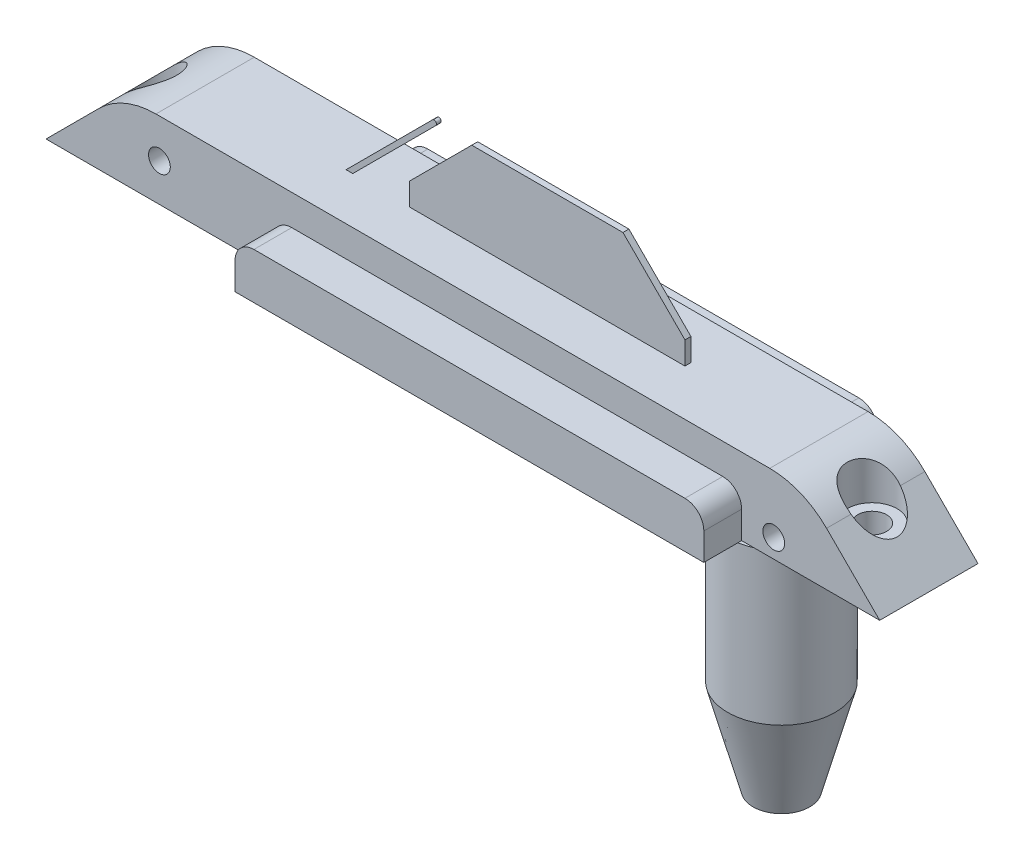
ISO-10303-21;
HEADER;
FILE_DESCRIPTION(('STEP AP214'),'2;1');
FILE_NAME('part.step','',(''),(''),'','','');
FILE_SCHEMA(('AUTOMOTIVE_DESIGN { 1 0 10303 214 1 1 1 1 }'));
ENDSEC;
DATA;
#1=APPLICATION_CONTEXT('core data for automotive mechanical design processes');
#2=APPLICATION_PROTOCOL_DEFINITION('international standard','automotive_design',2000,#1);
#3=PRODUCT_CONTEXT('',#1,'mechanical');
#4=PRODUCT('Part','Part','',(#3));
#5=PRODUCT_RELATED_PRODUCT_CATEGORY('part','',(#4));
#6=PRODUCT_DEFINITION_FORMATION('','',#4);
#7=PRODUCT_DEFINITION_CONTEXT('part definition',#1,'design');
#8=PRODUCT_DEFINITION('design','',#6,#7);
#9=PRODUCT_DEFINITION_SHAPE('','',#8);
#10=(LENGTH_UNIT() NAMED_UNIT(*) SI_UNIT(.MILLI.,.METRE.));
#11=(NAMED_UNIT(*) PLANE_ANGLE_UNIT() SI_UNIT($,.RADIAN.));
#12=(NAMED_UNIT(*) SI_UNIT($,.STERADIAN.) SOLID_ANGLE_UNIT());
#13=UNCERTAINTY_MEASURE_WITH_UNIT(LENGTH_MEASURE(1.E-05),#10,'distance_accuracy_value','');
#14=(GEOMETRIC_REPRESENTATION_CONTEXT(3) GLOBAL_UNCERTAINTY_ASSIGNED_CONTEXT((#13)) GLOBAL_UNIT_ASSIGNED_CONTEXT((#10,
#11,#12)) REPRESENTATION_CONTEXT('',''));
#15=CARTESIAN_POINT('',(0.,0.,0.));
#16=DIRECTION('',(0.,0.,1.));
#17=DIRECTION('',(1.,0.,0.));
#18=AXIS2_PLACEMENT_3D('',#15,#16,#17);
#19=CARTESIAN_POINT('',(-115.2652,0.,8.25500000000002));
#20=DIRECTION('',(0.,1.,0.));
#21=DIRECTION('',(0.,0.,1.));
#22=AXIS2_PLACEMENT_3D('',#19,#20,#21);
#23=PLANE('',#22);
#24=CARTESIAN_POINT('',(15.24,0.,0.));
#25=DIRECTION('',(0.,1.,0.));
#26=DIRECTION('',(0.,0.,1.));
#27=AXIS2_PLACEMENT_3D('',#24,#25,#26);
#28=CIRCLE('',#27,2.4384);
#29=CARTESIAN_POINT('',(15.24,0.,2.4384));
#30=VERTEX_POINT('',#29);
#31=EDGE_CURVE('E424',#30,#30,#28,.T.);
#32=ORIENTED_EDGE('',*,*,#31,.T.);
#33=EDGE_LOOP('',(#32));
#34=FACE_BOUND('',#33,.T.);
#35=CARTESIAN_POINT('',(0.,0.,0.));
#36=DIRECTION('',(0.,-1.,0.));
#37=DIRECTION('',(0.,0.,-1.));
#38=AXIS2_PLACEMENT_3D('',#35,#36,#37);
#39=CIRCLE('',#38,9.017);
#40=CARTESIAN_POINT('',(3.6278456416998,0.,-8.25499999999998));
#41=VERTEX_POINT('',#40);
#42=CARTESIAN_POINT('',(3.62784564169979,0.,8.25499999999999));
#43=VERTEX_POINT('',#42);
#44=EDGE_CURVE('E11',#41,#43,#39,.T.);
#45=ORIENTED_EDGE('',*,*,#44,.F.);
#46=DIRECTION('',(-1.,0.,0.));
#47=VECTOR('',#46,1.);
#48=CARTESIAN_POINT('',(-115.2652,0.,-8.25499999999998));
#49=LINE('',#48,#47);
#50=CARTESIAN_POINT('',(24.765,0.,-8.25499999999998));
#51=VERTEX_POINT('',#50);
#52=EDGE_CURVE('E470',#51,#41,#49,.T.);
#53=ORIENTED_EDGE('',*,*,#52,.F.);
#54=DIRECTION('',(0.,0.,-1.));
#55=VECTOR('',#54,1.);
#56=CARTESIAN_POINT('',(24.765,0.,-8.25499999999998));
#57=LINE('',#56,#55);
#58=CARTESIAN_POINT('',(24.765,0.,8.25499999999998));
#59=VERTEX_POINT('',#58);
#60=EDGE_CURVE('E477',#59,#51,#57,.T.);
#61=ORIENTED_EDGE('',*,*,#60,.F.);
#62=DIRECTION('',(1.,0.,0.));
#63=VECTOR('',#62,1.);
#64=CARTESIAN_POINT('',(-115.2652,0.,8.25500000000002));
#65=LINE('',#64,#63);
#66=EDGE_CURVE('E62',#43,#59,#65,.T.);
#67=ORIENTED_EDGE('',*,*,#66,.F.);
#68=EDGE_LOOP('',(#45,#53,#61,#67));
#69=FACE_BOUND('',#68,.T.);
#70=ADVANCED_FACE('F36',(#34,#69),#23,.F.);
#71=CARTESIAN_POINT('',(-105.7402,0.,0.));
#72=DIRECTION('',(0.,1.,0.));
#73=DIRECTION('',(0.,0.,1.));
#74=AXIS2_PLACEMENT_3D('',#71,#72,#73);
#75=CIRCLE('',#74,2.43839999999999);
#76=CARTESIAN_POINT('',(-105.7402,0.,2.43839999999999));
#77=VERTEX_POINT('',#76);
#78=EDGE_CURVE('E412',#77,#77,#75,.T.);
#79=ORIENTED_EDGE('',*,*,#78,.T.);
#80=EDGE_LOOP('',(#79));
#81=FACE_BOUND('',#80,.T.);
#82=CARTESIAN_POINT('',(1.57480000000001,0.,8.8784173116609));
#83=VERTEX_POINT('',#82);
#84=CARTESIAN_POINT('',(1.57480000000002,0.,-8.8784173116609));
#85=VERTEX_POINT('',#84);
#86=EDGE_CURVE('E46',#83,#85,#39,.T.);
#87=ORIENTED_EDGE('',*,*,#86,.F.);
#88=DIRECTION('',(0.,0.,-1.));
#89=VECTOR('',#88,1.);
#90=CARTESIAN_POINT('',(1.57480000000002,0.,14.605));
#91=LINE('',#90,#89);
#92=CARTESIAN_POINT('',(1.57480000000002,0.,14.605));
#93=VERTEX_POINT('',#92);
#94=EDGE_CURVE('E262',#93,#83,#91,.T.);
#95=ORIENTED_EDGE('',*,*,#94,.F.);
#96=DIRECTION('',(1.,0.,0.));
#97=VECTOR('',#96,1.);
#98=CARTESIAN_POINT('',(1.57480000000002,0.,14.605));
#99=LINE('',#98,#97);
#100=CARTESIAN_POINT('',(-77.1652,0.,14.605));
#101=VERTEX_POINT('',#100);
#102=EDGE_CURVE('E294',#101,#93,#99,.T.);
#103=ORIENTED_EDGE('',*,*,#102,.F.);
#104=DIRECTION('',(0.,0.,-1.));
#105=VECTOR('',#104,1.);
#106=CARTESIAN_POINT('',(-77.1652,0.,14.605));
#107=LINE('',#106,#105);
#108=CARTESIAN_POINT('',(-77.1652,0.,8.25500000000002));
#109=VERTEX_POINT('',#108);
#110=EDGE_CURVE('E323',#101,#109,#107,.T.);
#111=ORIENTED_EDGE('',*,*,#110,.T.);
#112=CARTESIAN_POINT('',(-115.2652,0.,8.25500000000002));
#113=VERTEX_POINT('',#112);
#114=EDGE_CURVE('E475',#113,#109,#65,.T.);
#115=ORIENTED_EDGE('',*,*,#114,.F.);
#116=DIRECTION('',(0.,0.,1.));
#117=VECTOR('',#116,1.);
#118=CARTESIAN_POINT('',(-115.2652,0.,-8.25499999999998));
#119=LINE('',#118,#117);
#120=CARTESIAN_POINT('',(-115.2652,0.,-8.25499999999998));
#121=VERTEX_POINT('',#120);
#122=EDGE_CURVE('E465',#121,#113,#119,.T.);
#123=ORIENTED_EDGE('',*,*,#122,.F.);
#124=CARTESIAN_POINT('',(-77.1652,0.,-8.25499999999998));
#125=VERTEX_POINT('',#124);
#126=EDGE_CURVE('E481',#125,#121,#49,.T.);
#127=ORIENTED_EDGE('',*,*,#126,.F.);
#128=CARTESIAN_POINT('',(-77.1652,0.,-14.605));
#129=VERTEX_POINT('',#128);
#130=EDGE_CURVE('E308',#125,#129,#107,.T.);
#131=ORIENTED_EDGE('',*,*,#130,.T.);
#132=DIRECTION('',(1.,0.,0.));
#133=VECTOR('',#132,1.);
#134=CARTESIAN_POINT('',(1.57480000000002,0.,-14.605));
#135=LINE('',#134,#133);
#136=CARTESIAN_POINT('',(1.57480000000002,0.,-14.605));
#137=VERTEX_POINT('',#136);
#138=EDGE_CURVE('E266',#129,#137,#135,.T.);
#139=ORIENTED_EDGE('',*,*,#138,.T.);
#140=EDGE_CURVE('E254',#85,#137,#91,.T.);
#141=ORIENTED_EDGE('',*,*,#140,.F.);
#142=EDGE_LOOP('',(#87,#95,#103,#111,#115,#123,#127,#131,#139,#141));
#143=FACE_BOUND('',#142,.T.);
#144=ADVANCED_FACE('F264',(#81,#143),#23,.F.);
#145=CARTESIAN_POINT('',(-115.2652,12.8778,8.25500000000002));
#146=DIRECTION('',(0.,0.,-1.));
#147=DIRECTION('',(-1.,0.,0.));
#148=AXIS2_PLACEMENT_3D('',#145,#146,#147);
#149=PLANE('',#148);
#150=CARTESIAN_POINT('',(6.9723,3.175,8.25499999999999));
#151=DIRECTION('',(0.,0.,-1.));
#152=DIRECTION('',(-1.,0.,0.));
#153=AXIS2_PLACEMENT_3D('',#150,#151,#152);
#154=CIRCLE('',#153,1.8288);
#155=CARTESIAN_POINT('',(5.1435,3.175,8.25499999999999));
#156=VERTEX_POINT('',#155);
#157=EDGE_CURVE('E285',#156,#156,#154,.T.);
#158=ORIENTED_EDGE('',*,*,#157,.T.);
#159=EDGE_LOOP('',(#158));
#160=FACE_BOUND('',#159,.T.);
#161=CARTESIAN_POINT('',(-96.2152,6.35,8.25500000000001));
#162=DIRECTION('',(0.,0.,-1.));
#163=DIRECTION('',(-1.,0.,0.));
#164=AXIS2_PLACEMENT_3D('',#161,#162,#163);
#165=CIRCLE('',#164,1.82879999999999);
#166=CARTESIAN_POINT('',(-98.044,6.35,8.25500000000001));
#167=VERTEX_POINT('',#166);
#168=EDGE_CURVE('E291',#167,#167,#165,.T.);
#169=ORIENTED_EDGE('',*,*,#168,.T.);
#170=EDGE_LOOP('',(#169));
#171=FACE_BOUND('',#170,.T.);
#172=DIRECTION('',(0.,1.,0.));
#173=VECTOR('',#172,1.);
#174=CARTESIAN_POINT('',(1.57480000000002,12.8778,8.25499999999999));
#175=LINE('',#174,#173);
#176=CARTESIAN_POINT('',(1.57480000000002,0.,8.25499999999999));
#177=VERTEX_POINT('',#176);
#178=CARTESIAN_POINT('',(1.57480000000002,4.57199999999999,8.25499999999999));
#179=VERTEX_POINT('',#178);
#180=EDGE_CURVE('E348',#177,#179,#175,.T.);
#181=ORIENTED_EDGE('',*,*,#180,.F.);
#182=EDGE_CURVE('E478',#177,#43,#65,.T.);
#183=ORIENTED_EDGE('',*,*,#182,.T.);
#184=ORIENTED_EDGE('',*,*,#66,.T.);
#185=DIRECTION('',(0.707106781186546,-0.707106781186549,0.));
#186=VECTOR('',#185,1.);
#187=CARTESIAN_POINT('',(11.8872,12.8778,8.25500000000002));
#188=LINE('',#187,#186);
#189=CARTESIAN_POINT('',(15.8394278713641,8.92557212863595,8.25500000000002));
#190=VERTEX_POINT('',#189);
#191=EDGE_CURVE('E436',#190,#59,#188,.T.);
#192=ORIENTED_EDGE('',*,*,#191,.F.);
#193=CARTESIAN_POINT('',(6.29790574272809,-0.615949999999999,8.25499999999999));
#194=DIRECTION('',(0.,0.,-1.));
#195=DIRECTION('',(-1.,0.,0.));
#196=AXIS2_PLACEMENT_3D('',#193,#194,#195);
#197=CIRCLE('',#196,13.49375);
#198=CARTESIAN_POINT('',(6.29790574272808,12.8778,8.25499999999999));
#199=VERTEX_POINT('',#198);
#200=EDGE_CURVE('E496',#190,#199,#197,.F.);
#201=ORIENTED_EDGE('',*,*,#200,.T.);
#202=DIRECTION('',(1.,0.,0.));
#203=VECTOR('',#202,1.);
#204=CARTESIAN_POINT('',(-115.2652,12.8778,8.25500000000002));
#205=LINE('',#204,#203);
#206=CARTESIAN_POINT('',(-96.7981057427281,12.8778,8.25500000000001));
#207=VERTEX_POINT('',#206);
#208=EDGE_CURVE('E466',#207,#199,#205,.T.);
#209=ORIENTED_EDGE('',*,*,#208,.F.);
#210=CARTESIAN_POINT('',(-96.7981057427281,-0.615949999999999,8.25500000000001));
#211=DIRECTION('',(0.,0.,-1.));
#212=DIRECTION('',(-1.,0.,0.));
#213=AXIS2_PLACEMENT_3D('',#210,#211,#212);
#214=CIRCLE('',#213,13.49375);
#215=CARTESIAN_POINT('',(-106.339627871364,8.92557212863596,8.25500000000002));
#216=VERTEX_POINT('',#215);
#217=EDGE_CURVE('E494',#207,#216,#214,.F.);
#218=ORIENTED_EDGE('',*,*,#217,.T.);
#219=DIRECTION('',(0.707106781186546,0.707106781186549,0.));
#220=VECTOR('',#219,1.);
#221=CARTESIAN_POINT('',(-115.2652,0.,8.25500000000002));
#222=LINE('',#221,#220);
#223=EDGE_CURVE('E430',#113,#216,#222,.T.);
#224=ORIENTED_EDGE('',*,*,#223,.F.);
#225=ORIENTED_EDGE('',*,*,#114,.T.);
#226=DIRECTION('',(0.,-1.,0.));
#227=VECTOR('',#226,1.);
#228=CARTESIAN_POINT('',(-77.1652,12.8778,8.25500000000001));
#229=LINE('',#228,#227);
#230=CARTESIAN_POINT('',(-77.1652,4.57199999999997,8.25500000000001));
#231=VERTEX_POINT('',#230);
#232=EDGE_CURVE('E344',#231,#109,#229,.T.);
#233=ORIENTED_EDGE('',*,*,#232,.F.);
#234=CARTESIAN_POINT('',(-73.9902,4.57199999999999,8.25500000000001));
#235=DIRECTION('',(0.,0.,-1.));
#236=DIRECTION('',(-1.,0.,0.));
#237=AXIS2_PLACEMENT_3D('',#234,#235,#236);
#238=CIRCLE('',#237,3.175);
#239=CARTESIAN_POINT('',(-73.9902,7.74699999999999,8.25500000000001));
#240=VERTEX_POINT('',#239);
#241=EDGE_CURVE('E351',#240,#231,#238,.F.);
#242=ORIENTED_EDGE('',*,*,#241,.F.);
#243=DIRECTION('',(-1.,0.,0.));
#244=VECTOR('',#243,1.);
#245=CARTESIAN_POINT('',(-115.2652,7.74699999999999,8.25500000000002));
#246=LINE('',#245,#244);
#247=CARTESIAN_POINT('',(-1.60019999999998,7.74699999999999,8.25499999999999));
#248=VERTEX_POINT('',#247);
#249=EDGE_CURVE('E354',#248,#240,#246,.T.);
#250=ORIENTED_EDGE('',*,*,#249,.F.);
#251=CARTESIAN_POINT('',(-1.60019999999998,4.57199999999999,8.25499999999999));
#252=DIRECTION('',(0.,0.,-1.));
#253=DIRECTION('',(-1.,0.,0.));
#254=AXIS2_PLACEMENT_3D('',#251,#252,#253);
#255=CIRCLE('',#254,3.175);
#256=EDGE_CURVE('E357',#179,#248,#255,.F.);
#257=ORIENTED_EDGE('',*,*,#256,.F.);
#258=EDGE_LOOP('',(#181,#183,#184,#192,#201,#209,#218,#224,#225,#233,#242,#250,#257));
#259=FACE_BOUND('',#258,.T.);
#260=ADVANCED_FACE('F580',(#160,#171,#259),#149,.F.);
#261=CARTESIAN_POINT('',(-115.2652,12.8778,-8.25499999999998));
#262=DIRECTION('',(0.,0.,1.));
#263=DIRECTION('',(1.,0.,0.));
#264=AXIS2_PLACEMENT_3D('',#261,#262,#263);
#265=PLANE('',#264);
#266=CARTESIAN_POINT('',(6.9723,3.175,-8.25499999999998));
#267=DIRECTION('',(0.,0.,-1.));
#268=DIRECTION('',(-1.,0.,0.));
#269=AXIS2_PLACEMENT_3D('',#266,#267,#268);
#270=CIRCLE('',#269,1.8288);
#271=CARTESIAN_POINT('',(5.1435,3.175,-8.25499999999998));
#272=VERTEX_POINT('',#271);
#273=EDGE_CURVE('E278',#272,#272,#270,.T.);
#274=ORIENTED_EDGE('',*,*,#273,.F.);
#275=EDGE_LOOP('',(#274));
#276=FACE_BOUND('',#275,.T.);
#277=CARTESIAN_POINT('',(-96.2152,6.35,-8.25499999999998));
#278=DIRECTION('',(0.,0.,-1.));
#279=DIRECTION('',(-1.,0.,0.));
#280=AXIS2_PLACEMENT_3D('',#277,#278,#279);
#281=CIRCLE('',#280,1.82879999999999);
#282=CARTESIAN_POINT('',(-98.044,6.35,-8.25499999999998));
#283=VERTEX_POINT('',#282);
#284=EDGE_CURVE('E288',#283,#283,#281,.T.);
#285=ORIENTED_EDGE('',*,*,#284,.F.);
#286=EDGE_LOOP('',(#285));
#287=FACE_BOUND('',#286,.T.);
#288=DIRECTION('',(0.,-1.,0.));
#289=VECTOR('',#288,1.);
#290=CARTESIAN_POINT('',(1.57480000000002,12.8778,-8.25499999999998));
#291=LINE('',#290,#289);
#292=CARTESIAN_POINT('',(1.57480000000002,4.57199999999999,-8.25499999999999));
#293=VERTEX_POINT('',#292);
#294=CARTESIAN_POINT('',(1.57480000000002,0.,-8.25499999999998));
#295=VERTEX_POINT('',#294);
#296=EDGE_CURVE('E256',#293,#295,#291,.T.);
#297=ORIENTED_EDGE('',*,*,#296,.F.);
#298=CARTESIAN_POINT('',(-1.60019999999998,4.57199999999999,-8.25499999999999));
#299=DIRECTION('',(0.,0.,1.));
#300=DIRECTION('',(1.,0.,0.));
#301=AXIS2_PLACEMENT_3D('',#298,#299,#300);
#302=CIRCLE('',#301,3.175);
#303=CARTESIAN_POINT('',(-1.60019999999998,7.74699999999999,-8.25499999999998));
#304=VERTEX_POINT('',#303);
#305=EDGE_CURVE('E41',#304,#293,#302,.F.);
#306=ORIENTED_EDGE('',*,*,#305,.F.);
#307=DIRECTION('',(1.,0.,0.));
#308=VECTOR('',#307,1.);
#309=CARTESIAN_POINT('',(-115.2652,7.74699999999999,-8.25499999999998));
#310=LINE('',#309,#308);
#311=CARTESIAN_POINT('',(-73.9902,7.74699999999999,-8.25499999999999));
#312=VERTEX_POINT('',#311);
#313=EDGE_CURVE('E731',#312,#304,#310,.T.);
#314=ORIENTED_EDGE('',*,*,#313,.F.);
#315=CARTESIAN_POINT('',(-73.9902,4.57199999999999,-8.25499999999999));
#316=DIRECTION('',(0.,0.,1.));
#317=DIRECTION('',(1.,0.,0.));
#318=AXIS2_PLACEMENT_3D('',#315,#316,#317);
#319=CIRCLE('',#318,3.175);
#320=CARTESIAN_POINT('',(-77.1652,4.57199999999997,-8.25499999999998));
#321=VERTEX_POINT('',#320);
#322=EDGE_CURVE('E717',#321,#312,#319,.F.);
#323=ORIENTED_EDGE('',*,*,#322,.F.);
#324=DIRECTION('',(0.,1.,0.));
#325=VECTOR('',#324,1.);
#326=CARTESIAN_POINT('',(-77.1652,12.8778,-8.25499999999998));
#327=LINE('',#326,#325);
#328=EDGE_CURVE('E341',#125,#321,#327,.T.);
#329=ORIENTED_EDGE('',*,*,#328,.F.);
#330=ORIENTED_EDGE('',*,*,#126,.T.);
#331=DIRECTION('',(0.707106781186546,0.707106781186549,0.));
#332=VECTOR('',#331,1.);
#333=CARTESIAN_POINT('',(-115.2652,0.,-8.25499999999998));
#334=LINE('',#333,#332);
#335=CARTESIAN_POINT('',(-106.339627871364,8.92557212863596,-8.25499999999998));
#336=VERTEX_POINT('',#335);
#337=EDGE_CURVE('E433',#121,#336,#334,.T.);
#338=ORIENTED_EDGE('',*,*,#337,.T.);
#339=CARTESIAN_POINT('',(-96.7981057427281,-0.615949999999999,-8.25499999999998));
#340=DIRECTION('',(0.,0.,1.));
#341=DIRECTION('',(1.,0.,0.));
#342=AXIS2_PLACEMENT_3D('',#339,#340,#341);
#343=CIRCLE('',#342,13.49375);
#344=CARTESIAN_POINT('',(-96.7981057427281,12.8778,-8.25499999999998));
#345=VERTEX_POINT('',#344);
#346=EDGE_CURVE('E503',#336,#345,#343,.F.);
#347=ORIENTED_EDGE('',*,*,#346,.T.);
#348=DIRECTION('',(-1.,0.,0.));
#349=VECTOR('',#348,1.);
#350=CARTESIAN_POINT('',(-115.2652,12.8778,-8.25499999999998));
#351=LINE('',#350,#349);
#352=CARTESIAN_POINT('',(6.29790574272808,12.8778,-8.25499999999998));
#353=VERTEX_POINT('',#352);
#354=EDGE_CURVE('E469',#353,#345,#351,.T.);
#355=ORIENTED_EDGE('',*,*,#354,.F.);
#356=CARTESIAN_POINT('',(6.29790574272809,-0.615949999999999,-8.25499999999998));
#357=DIRECTION('',(0.,0.,1.));
#358=DIRECTION('',(1.,0.,0.));
#359=AXIS2_PLACEMENT_3D('',#356,#357,#358);
#360=CIRCLE('',#359,13.49375);
#361=CARTESIAN_POINT('',(15.8394278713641,8.92557212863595,-8.25499999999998));
#362=VERTEX_POINT('',#361);
#363=EDGE_CURVE('E505',#353,#362,#360,.F.);
#364=ORIENTED_EDGE('',*,*,#363,.T.);
#365=DIRECTION('',(0.707106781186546,-0.707106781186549,0.));
#366=VECTOR('',#365,1.);
#367=CARTESIAN_POINT('',(11.8872,12.8778,-8.25499999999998));
#368=LINE('',#367,#366);
#369=EDGE_CURVE('E439',#362,#51,#368,.T.);
#370=ORIENTED_EDGE('',*,*,#369,.T.);
#371=ORIENTED_EDGE('',*,*,#52,.T.);
#372=EDGE_CURVE('E275',#41,#295,#49,.T.);
#373=ORIENTED_EDGE('',*,*,#372,.T.);
#374=EDGE_LOOP('',(#297,#306,#314,#323,#329,#330,#338,#347,#355,#364,#370,#371,#373));
#375=FACE_BOUND('',#374,.T.);
#376=ADVANCED_FACE('F574',(#276,#287,#375),#265,.F.);
#377=CARTESIAN_POINT('',(-115.2652,12.8778,8.25500000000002));
#378=DIRECTION('',(0.,1.,0.));
#379=DIRECTION('',(0.,0.,1.));
#380=AXIS2_PLACEMENT_3D('',#377,#378,#379);
#381=PLANE('',#380);
#382=DIRECTION('',(0.,0.,1.));
#383=VECTOR('',#382,1.);
#384=CARTESIAN_POINT('',(-71.5976679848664,12.8778,8.25500000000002));
#385=LINE('',#384,#383);
#386=CARTESIAN_POINT('',(-71.5976679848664,12.8778,-0.396875));
#387=VERTEX_POINT('',#386);
#388=CARTESIAN_POINT('',(-71.5976679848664,12.8778,0.396875));
#389=VERTEX_POINT('',#388);
#390=EDGE_CURVE('E486',#387,#389,#385,.T.);
#391=ORIENTED_EDGE('',*,*,#390,.T.);
#392=DIRECTION('',(-1.,0.,0.));
#393=VECTOR('',#392,1.);
#394=CARTESIAN_POINT('',(-115.2652,12.8778,0.396875));
#395=LINE('',#394,#393);
#396=CARTESIAN_POINT('',(-72.7202,12.8778,0.396875));
#397=VERTEX_POINT('',#396);
#398=EDGE_CURVE('E488',#389,#397,#395,.T.);
#399=ORIENTED_EDGE('',*,*,#398,.T.);
#400=DIRECTION('',(0.,0.,-1.));
#401=VECTOR('',#400,1.);
#402=CARTESIAN_POINT('',(-72.7202,12.8778,0.396875));
#403=LINE('',#402,#401);
#404=CARTESIAN_POINT('',(-72.7202,12.8778,-0.396875));
#405=VERTEX_POINT('',#404);
#406=EDGE_CURVE('E460',#397,#405,#403,.T.);
#407=ORIENTED_EDGE('',*,*,#406,.T.);
#408=DIRECTION('',(-1.,0.,0.));
#409=VECTOR('',#408,1.);
#410=CARTESIAN_POINT('',(-115.2652,12.8778,-0.396875));
#411=LINE('',#410,#409);
#412=EDGE_CURVE('E473',#387,#405,#411,.T.);
#413=ORIENTED_EDGE('',*,*,#412,.F.);
#414=EDGE_LOOP('',(#391,#399,#407,#413));
#415=FACE_BOUND('',#414,.T.);
#416=ORIENTED_EDGE('',*,*,#208,.T.);
#417=DIRECTION('',(0.,0.,1.));
#418=VECTOR('',#417,1.);
#419=CARTESIAN_POINT('',(6.29790574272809,12.8778,-8.25499999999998));
#420=LINE('',#419,#418);
#421=EDGE_CURVE('E501',#199,#353,#420,.F.);
#422=ORIENTED_EDGE('',*,*,#421,.T.);
#423=ORIENTED_EDGE('',*,*,#354,.T.);
#424=DIRECTION('',(0.,0.,1.));
#425=VECTOR('',#424,1.);
#426=CARTESIAN_POINT('',(-96.7981057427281,12.8778,8.25500000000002));
#427=LINE('',#426,#425);
#428=EDGE_CURVE('E498',#345,#207,#427,.T.);
#429=ORIENTED_EDGE('',*,*,#428,.T.);
#430=EDGE_LOOP('',(#416,#422,#423,#429));
#431=FACE_BOUND('',#430,.T.);
#432=DIRECTION('',(0.,0.,-1.));
#433=VECTOR('',#432,1.);
#434=CARTESIAN_POINT('',(-15.6972,12.8778,0.5));
#435=LINE('',#434,#433);
#436=CARTESIAN_POINT('',(-15.6972,12.8778,0.5));
#437=VERTEX_POINT('',#436);
#438=CARTESIAN_POINT('',(-15.6972,12.8778,-0.5));
#439=VERTEX_POINT('',#438);
#440=EDGE_CURVE('E398',#437,#439,#435,.T.);
#441=ORIENTED_EDGE('',*,*,#440,.F.);
#442=DIRECTION('',(1.,0.,0.));
#443=VECTOR('',#442,1.);
#444=CARTESIAN_POINT('',(-61.9252,12.8778,0.5));
#445=LINE('',#444,#443);
#446=CARTESIAN_POINT('',(-61.9252,12.8778,0.5));
#447=VERTEX_POINT('',#446);
#448=EDGE_CURVE('E368',#447,#437,#445,.T.);
#449=ORIENTED_EDGE('',*,*,#448,.F.);
#450=DIRECTION('',(0.,0.,-1.));
#451=VECTOR('',#450,1.);
#452=CARTESIAN_POINT('',(-61.9252,12.8778,0.5));
#453=LINE('',#452,#451);
#454=CARTESIAN_POINT('',(-61.9252,12.8778,-0.5));
#455=VERTEX_POINT('',#454);
#456=EDGE_CURVE('E401',#447,#455,#453,.T.);
#457=ORIENTED_EDGE('',*,*,#456,.T.);
#458=DIRECTION('',(1.,0.,0.));
#459=VECTOR('',#458,1.);
#460=CARTESIAN_POINT('',(-61.9252,12.8778,-0.5));
#461=LINE('',#460,#459);
#462=EDGE_CURVE('E383',#455,#439,#461,.T.);
#463=ORIENTED_EDGE('',*,*,#462,.T.);
#464=EDGE_LOOP('',(#441,#449,#457,#463));
#465=FACE_BOUND('',#464,.T.);
#466=ADVANCED_FACE('F570',(#415,#431,#465),#381,.T.);
#467=CARTESIAN_POINT('',(-57.934933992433,27.1018,0.396875));
#468=DIRECTION('',(0.,0.,-1.));
#469=DIRECTION('',(-1.,0.,0.));
#470=AXIS2_PLACEMENT_3D('',#467,#468,#469);
#471=CYLINDRICAL_SURFACE('',#470,0.396875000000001);
#472=CARTESIAN_POINT('',(-57.934933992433,27.1018,-0.396875));
#473=DIRECTION('',(0.,0.,1.));
#474=DIRECTION('',(-1.,0.,0.));
#475=AXIS2_PLACEMENT_3D('',#472,#473,#474);
#476=CIRCLE('',#475,0.396875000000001);
#477=CARTESIAN_POINT('',(-57.6543009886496,26.8211669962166,-0.396875));
#478=VERTEX_POINT('',#477);
#479=CARTESIAN_POINT('',(-58.2155669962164,27.3824330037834,-0.396875));
#480=VERTEX_POINT('',#479);
#481=EDGE_CURVE('E441',#478,#480,#476,.T.);
#482=ORIENTED_EDGE('',*,*,#481,.T.);
#483=DIRECTION('',(0.,0.,-1.));
#484=VECTOR('',#483,1.);
#485=CARTESIAN_POINT('',(-58.2155669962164,27.3824330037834,0.396875));
#486=LINE('',#485,#484);
#487=CARTESIAN_POINT('',(-58.2155669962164,27.3824330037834,0.396875));
#488=VERTEX_POINT('',#487);
#489=EDGE_CURVE('E462',#488,#480,#486,.T.);
#490=ORIENTED_EDGE('',*,*,#489,.F.);
#491=CARTESIAN_POINT('',(-57.934933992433,27.1018,0.396875));
#492=DIRECTION('',(0.,0.,1.));
#493=DIRECTION('',(-1.,0.,0.));
#494=AXIS2_PLACEMENT_3D('',#491,#492,#493);
#495=CIRCLE('',#494,0.396875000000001);
#496=CARTESIAN_POINT('',(-57.6543009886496,26.8211669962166,0.396875));
#497=VERTEX_POINT('',#496);
#498=EDGE_CURVE('E442',#497,#488,#495,.T.);
#499=ORIENTED_EDGE('',*,*,#498,.F.);
#500=DIRECTION('',(0.,0.,-1.));
#501=VECTOR('',#500,1.);
#502=CARTESIAN_POINT('',(-57.6543009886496,26.8211669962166,0.396875));
#503=LINE('',#502,#501);
#504=EDGE_CURVE('E451',#497,#478,#503,.T.);
#505=ORIENTED_EDGE('',*,*,#504,.T.);
#506=EDGE_LOOP('',(#482,#490,#499,#505));
#507=FACE_BOUND('',#506,.T.);
#508=ADVANCED_FACE('F566',(#507),#471,.T.);
#509=CARTESIAN_POINT('',(-58.2155669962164,27.3824330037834,0.396875));
#510=DIRECTION('',(0.707106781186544,-0.707106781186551,0.));
#511=DIRECTION('',(0.707106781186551,0.707106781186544,0.));
#512=AXIS2_PLACEMENT_3D('',#509,#510,#511);
#513=PLANE('',#512);
#514=DIRECTION('',(-0.707106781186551,-0.707106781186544,0.));
#515=VECTOR('',#514,1.);
#516=CARTESIAN_POINT('',(-58.2155669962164,27.3824330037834,-0.396875));
#517=LINE('',#516,#515);
#518=EDGE_CURVE('E454',#480,#405,#517,.T.);
#519=ORIENTED_EDGE('',*,*,#518,.T.);
#520=ORIENTED_EDGE('',*,*,#406,.F.);
#521=DIRECTION('',(-0.707106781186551,-0.707106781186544,0.));
#522=VECTOR('',#521,1.);
#523=CARTESIAN_POINT('',(-58.2155669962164,27.3824330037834,0.396875));
#524=LINE('',#523,#522);
#525=EDGE_CURVE('E445',#488,#397,#524,.T.);
#526=ORIENTED_EDGE('',*,*,#525,.F.);
#527=ORIENTED_EDGE('',*,*,#489,.T.);
#528=EDGE_LOOP('',(#519,#520,#526,#527));
#529=FACE_BOUND('',#528,.T.);
#530=ADVANCED_FACE('F562',(#529),#513,.F.);
#531=CARTESIAN_POINT('',(-57.6543009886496,26.8211669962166,0.396875));
#532=DIRECTION('',(-0.707106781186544,0.707106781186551,0.));
#533=DIRECTION('',(-0.707106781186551,-0.707106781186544,0.));
#534=AXIS2_PLACEMENT_3D('',#531,#532,#533);
#535=PLANE('',#534);
#536=ORIENTED_EDGE('',*,*,#390,.F.);
#537=DIRECTION('',(0.707106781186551,0.707106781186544,0.));
#538=VECTOR('',#537,1.);
#539=CARTESIAN_POINT('',(-57.6543009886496,26.8211669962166,-0.396875));
#540=LINE('',#539,#538);
#541=EDGE_CURVE('E446',#387,#478,#540,.T.);
#542=ORIENTED_EDGE('',*,*,#541,.T.);
#543=ORIENTED_EDGE('',*,*,#504,.F.);
#544=DIRECTION('',(0.707106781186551,0.707106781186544,0.));
#545=VECTOR('',#544,1.);
#546=CARTESIAN_POINT('',(-57.6543009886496,26.8211669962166,0.396875));
#547=LINE('',#546,#545);
#548=EDGE_CURVE('E449',#389,#497,#547,.T.);
#549=ORIENTED_EDGE('',*,*,#548,.F.);
#550=EDGE_LOOP('',(#536,#542,#543,#549));
#551=FACE_BOUND('',#550,.T.);
#552=ADVANCED_FACE('F555',(#551),#535,.F.);
#553=CARTESIAN_POINT('',(-57.934933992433,27.1018,0.396875));
#554=DIRECTION('',(0.,0.,-1.));
#555=DIRECTION('',(-1.,0.,0.));
#556=AXIS2_PLACEMENT_3D('',#553,#554,#555);
#557=PLANE('',#556);
#558=ORIENTED_EDGE('',*,*,#398,.F.);
#559=ORIENTED_EDGE('',*,*,#548,.T.);
#560=ORIENTED_EDGE('',*,*,#498,.T.);
#561=ORIENTED_EDGE('',*,*,#525,.T.);
#562=EDGE_LOOP('',(#558,#559,#560,#561));
#563=FACE_BOUND('',#562,.T.);
#564=ADVANCED_FACE('F552',(#563),#557,.F.);
#565=CARTESIAN_POINT('',(-57.934933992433,27.1018,-0.396875));
#566=DIRECTION('',(0.,0.,-1.));
#567=DIRECTION('',(-1.,0.,0.));
#568=AXIS2_PLACEMENT_3D('',#565,#566,#567);
#569=PLANE('',#568);
#570=ORIENTED_EDGE('',*,*,#541,.F.);
#571=ORIENTED_EDGE('',*,*,#412,.T.);
#572=ORIENTED_EDGE('',*,*,#518,.F.);
#573=ORIENTED_EDGE('',*,*,#481,.F.);
#574=EDGE_LOOP('',(#570,#571,#572,#573));
#575=FACE_BOUND('',#574,.T.);
#576=ADVANCED_FACE('F550',(#575),#569,.T.);
#577=CARTESIAN_POINT('',(11.8872,12.8778,-8.25499999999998));
#578=DIRECTION('',(-0.707106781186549,-0.707106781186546,0.));
#579=DIRECTION('',(0.707106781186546,-0.707106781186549,0.));
#580=AXIS2_PLACEMENT_3D('',#577,#578,#579);
#581=PLANE('',#580);
#582=DIRECTION('',(0.,0.,1.));
#583=VECTOR('',#582,1.);
#584=CARTESIAN_POINT('',(15.8394278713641,8.92557212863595,8.25500000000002));
#585=LINE('',#584,#583);
#586=CARTESIAN_POINT('',(15.8394278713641,8.92557212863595,-4.14791118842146));
#587=VERTEX_POINT('',#586);
#588=EDGE_CURVE('E491',#362,#587,#585,.T.);
#589=ORIENTED_EDGE('',*,*,#588,.T.);
#590=CARTESIAN_POINT('',(15.24,9.52500000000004,0.));
#591=DIRECTION('',(-0.707106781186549,-0.707106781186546,0.));
#592=DIRECTION('',(-0.707106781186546,0.707106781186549,0.));
#593=AXIS2_PLACEMENT_3D('',#590,#591,#592);
#594=ELLIPSE('',#593,5.92696903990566,4.191);
#595=CARTESIAN_POINT('',(15.8394278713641,8.92557212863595,4.14791118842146));
#596=VERTEX_POINT('',#595);
#597=EDGE_CURVE('E427',#587,#596,#594,.T.);
#598=ORIENTED_EDGE('',*,*,#597,.T.);
#599=EDGE_CURVE('E490',#596,#190,#585,.T.);
#600=ORIENTED_EDGE('',*,*,#599,.T.);
#601=ORIENTED_EDGE('',*,*,#191,.T.);
#602=ORIENTED_EDGE('',*,*,#60,.T.);
#603=ORIENTED_EDGE('',*,*,#369,.F.);
#604=EDGE_LOOP('',(#589,#598,#600,#601,#602,#603));
#605=FACE_BOUND('',#604,.T.);
#606=ADVANCED_FACE('F546',(#605),#581,.F.);
#607=CARTESIAN_POINT('',(-115.2652,0.,-8.25499999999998));
#608=DIRECTION('',(0.707106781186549,-0.707106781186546,0.));
#609=DIRECTION('',(0.707106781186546,0.707106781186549,0.));
#610=AXIS2_PLACEMENT_3D('',#607,#608,#609);
#611=PLANE('',#610);
#612=DIRECTION('',(0.,0.,1.));
#613=VECTOR('',#612,1.);
#614=CARTESIAN_POINT('',(-106.339627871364,8.92557212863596,-8.25499999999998));
#615=LINE('',#614,#613);
#616=CARTESIAN_POINT('',(-106.339627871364,8.92557212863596,4.14791118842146));
#617=VERTEX_POINT('',#616);
#618=EDGE_CURVE('E508',#216,#617,#615,.F.);
#619=ORIENTED_EDGE('',*,*,#618,.T.);
#620=CARTESIAN_POINT('',(-105.7402,9.52500000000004,0.));
#621=DIRECTION('',(0.707106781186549,-0.707106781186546,0.));
#622=DIRECTION('',(0.707106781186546,0.707106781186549,0.));
#623=AXIS2_PLACEMENT_3D('',#620,#621,#622);
#624=ELLIPSE('',#623,5.92696903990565,4.191);
#625=CARTESIAN_POINT('',(-106.339627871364,8.92557212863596,-4.14791118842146));
#626=VERTEX_POINT('',#625);
#627=EDGE_CURVE('E415',#617,#626,#624,.T.);
#628=ORIENTED_EDGE('',*,*,#627,.T.);
#629=EDGE_CURVE('E507',#626,#336,#615,.F.);
#630=ORIENTED_EDGE('',*,*,#629,.T.);
#631=ORIENTED_EDGE('',*,*,#337,.F.);
#632=ORIENTED_EDGE('',*,*,#122,.T.);
#633=ORIENTED_EDGE('',*,*,#223,.T.);
#634=EDGE_LOOP('',(#619,#628,#630,#631,#632,#633));
#635=FACE_BOUND('',#634,.T.);
#636=ADVANCED_FACE('F543',(#635),#611,.F.);
#637=CARTESIAN_POINT('',(6.29790574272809,-0.615949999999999,-8.25499999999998));
#638=DIRECTION('',(0.,0.,-1.));
#639=DIRECTION('',(-1.,0.,0.));
#640=AXIS2_PLACEMENT_3D('',#637,#638,#639);
#641=CYLINDRICAL_SURFACE('',#640,13.49375);
#642=CARTESIAN_POINT('',(15.8394278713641,8.92557212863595,-4.14791118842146));
#643=CARTESIAN_POINT('',(15.7150457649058,9.04998932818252,-4.16587880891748));
#644=CARTESIAN_POINT('',(15.5877491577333,9.17238626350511,-4.1785673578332));
#645=CARTESIAN_POINT('',(15.3278750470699,9.4126160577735,-4.19210499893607));
#646=CARTESIAN_POINT('',(15.1952878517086,9.53043967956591,-4.19293125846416));
#647=CARTESIAN_POINT('',(14.9249044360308,9.76133532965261,-4.18134263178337));
#648=CARTESIAN_POINT('',(14.7870778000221,9.87436745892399,-4.16883323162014));
#649=CARTESIAN_POINT('',(14.5084554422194,10.0938374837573,-4.12905580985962));
#650=CARTESIAN_POINT('',(14.3676622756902,10.2002807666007,-4.10180002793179));
#651=CARTESIAN_POINT('',(14.1206047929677,10.3796728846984,-4.04020773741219));
#652=CARTESIAN_POINT('',(14.0146428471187,10.4542679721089,-4.00942210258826));
#653=CARTESIAN_POINT('',(13.8028056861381,10.5989598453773,-3.93845457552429));
#654=CARTESIAN_POINT('',(13.6969304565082,10.6690576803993,-3.89827488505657));
#655=CARTESIAN_POINT('',(13.4865112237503,10.8042444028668,-3.80825658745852));
#656=CARTESIAN_POINT('',(13.3819644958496,10.8693457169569,-3.75844310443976));
#657=CARTESIAN_POINT('',(13.1750875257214,10.9944014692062,-3.64887781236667));
#658=CARTESIAN_POINT('',(13.0727562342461,11.0543583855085,-3.5891308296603));
#659=CARTESIAN_POINT('',(12.8706351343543,11.1693863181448,-3.45906802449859));
#660=CARTESIAN_POINT('',(12.7708736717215,11.2244123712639,-3.38866814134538));
#661=CARTESIAN_POINT('',(12.5761550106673,11.3288009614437,-3.23783391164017));
#662=CARTESIAN_POINT('',(12.4811956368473,11.3781660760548,-3.15740416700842));
#663=CARTESIAN_POINT('',(12.2973146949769,11.4711923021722,-2.98677515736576));
#664=CARTESIAN_POINT('',(12.2083971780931,11.5148496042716,-2.89656944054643));
#665=CARTESIAN_POINT('',(12.0379931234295,11.5964048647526,-2.707003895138));
#666=CARTESIAN_POINT('',(11.9565056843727,11.6343035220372,-2.60764517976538));
#667=CARTESIAN_POINT('',(11.8108940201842,11.7004580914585,-2.41222848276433));
#668=CARTESIAN_POINT('',(11.7458479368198,11.7293193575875,-2.31706011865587));
#669=CARTESIAN_POINT('',(11.6233566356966,11.7826517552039,-2.12078985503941));
#670=CARTESIAN_POINT('',(11.5659107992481,11.8071232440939,-2.01968843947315));
#671=CARTESIAN_POINT('',(11.4593289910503,11.8517819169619,-1.81234420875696));
#672=CARTESIAN_POINT('',(11.4101897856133,11.8719707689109,-1.70610341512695));
#673=CARTESIAN_POINT('',(11.3207779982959,11.9082015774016,-1.48927194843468));
#674=CARTESIAN_POINT('',(11.2805051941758,11.9242436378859,-1.37868138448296));
#675=CARTESIAN_POINT('',(11.2113594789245,11.9514905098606,-1.16054373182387));
#676=CARTESIAN_POINT('',(11.1819617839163,11.9629215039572,-1.05319079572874));
#677=CARTESIAN_POINT('',(11.131746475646,11.982303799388,-0.836148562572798));
#678=CARTESIAN_POINT('',(11.1109317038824,11.9902539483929,-0.726458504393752));
#679=CARTESIAN_POINT('',(11.0781159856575,12.0027340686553,-0.505626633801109));
#680=CARTESIAN_POINT('',(11.0661110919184,12.0072655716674,-0.394485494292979));
#681=CARTESIAN_POINT('',(11.0510176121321,12.0129566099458,-0.17147182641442));
#682=CARTESIAN_POINT('',(11.0479323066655,12.0141149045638,-0.0595990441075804));
#683=CARTESIAN_POINT('',(11.0507001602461,12.0130735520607,0.16257642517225));
#684=CARTESIAN_POINT('',(11.0564386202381,12.0109169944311,0.272880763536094));
#685=CARTESIAN_POINT('',(11.0765899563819,12.0033044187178,0.492620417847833));
#686=CARTESIAN_POINT('',(11.0910059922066,11.9978471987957,0.602055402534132));
#687=CARTESIAN_POINT('',(11.1283656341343,11.9835874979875,0.819191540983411));
#688=CARTESIAN_POINT('',(11.1513057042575,11.9747864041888,0.926893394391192));
#689=CARTESIAN_POINT('',(11.2054964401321,11.953763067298,1.13988685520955));
#690=CARTESIAN_POINT('',(11.236750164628,11.9415395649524,1.24517755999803));
#691=CARTESIAN_POINT('',(11.3072347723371,11.9135889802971,1.452523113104));
#692=CARTESIAN_POINT('',(11.346462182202,11.8978634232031,1.55457934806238));
#693=CARTESIAN_POINT('',(11.432518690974,11.86279982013,1.7548357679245));
#694=CARTESIAN_POINT('',(11.4793505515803,11.8434604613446,1.85303453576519));
#695=CARTESIAN_POINT('',(11.5801007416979,11.8010821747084,2.044834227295));
#696=CARTESIAN_POINT('',(11.6340158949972,11.7780449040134,2.13843718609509));
#697=CARTESIAN_POINT('',(11.7484077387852,11.7281664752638,2.32052387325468));
#698=CARTESIAN_POINT('',(11.8088868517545,11.7013239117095,2.40900569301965));
#699=CARTESIAN_POINT('',(11.9364518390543,11.6434560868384,2.58121096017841));
#700=CARTESIAN_POINT('',(12.0036019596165,11.6123888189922,2.66487276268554));
#701=CARTESIAN_POINT('',(12.1432422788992,11.5462585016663,2.82594339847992));
#702=CARTESIAN_POINT('',(12.2157343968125,11.5111940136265,2.90334996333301));
#703=CARTESIAN_POINT('',(12.4400645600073,11.399993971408,3.12554320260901));
#704=CARTESIAN_POINT('',(12.5988723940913,11.3178005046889,3.26045797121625));
#705=CARTESIAN_POINT('',(12.936098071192,11.1336985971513,3.50745918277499));
#706=CARTESIAN_POINT('',(13.1150816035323,11.0310579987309,3.61821238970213));
#707=CARTESIAN_POINT('',(13.4795028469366,10.8099592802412,3.80886442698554));
#708=CARTESIAN_POINT('',(13.6649421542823,10.6914972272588,3.88875556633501));
#709=CARTESIAN_POINT('',(14.0579374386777,10.4260463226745,4.02684510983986));
#710=CARTESIAN_POINT('',(14.2655750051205,10.2773429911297,4.08147401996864));
#711=CARTESIAN_POINT('',(14.6757903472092,9.96511439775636,4.15809681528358));
#712=CARTESIAN_POINT('',(14.8783625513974,9.8015736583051,4.18005619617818));
#713=CARTESIAN_POINT('',(15.2083039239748,9.51896094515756,4.19296720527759));
#714=CARTESIAN_POINT('',(15.3382922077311,9.40317304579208,4.19179848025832));
#715=CARTESIAN_POINT('',(15.5929010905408,9.1674250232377,4.17804913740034));
#716=CARTESIAN_POINT('',(15.71754029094,9.04748252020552,4.16551211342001));
#717=CARTESIAN_POINT('',(15.8394278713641,8.92557212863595,4.14791118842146));
#718=B_SPLINE_CURVE_WITH_KNOTS('',3,(#642,#643,#644,#645,#646,#647,#648,#649,#650,#651,#652,
#653,#654,#655,#656,#657,#658,#659,#660,#661,#662,#663,#664,#665,#666,#667,#668,#669,#670,#671,
#672,#673,#674,#675,#676,#677,#678,#679,#680,#681,#682,#683,#684,#685,#686,#687,#688,#689,#690,
#691,#692,#693,#694,#695,#696,#697,#698,#699,#700,#701,#702,#703,#704,#705,#706,#707,#708,#709,
#710,#711,#712,#713,#714,#715,#716,#717),.UNSPECIFIED.,.F.,.F.,(4,2,2,2,2,2,2,2,2,2,2,2,2,2,2,2,
2,2,2,2,2,2,2,2,2,2,2,2,2,2,2,2,2,2,2,2,2,4),(0.,0.530554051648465,1.06212918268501,
1.59749695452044,2.13242104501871,2.53162950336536,2.93074448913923,3.32883232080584,
3.72672729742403,4.12794372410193,4.52897673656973,4.93027604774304,5.33152661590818,
5.68756409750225,6.04357257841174,6.39944214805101,6.75530279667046,7.09057279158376,
7.42595369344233,7.7611842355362,8.09653805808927,8.4275693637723,8.75872127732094,
9.08973597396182,9.42087262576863,9.75186534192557,10.0829785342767,10.4139437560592,
10.7450315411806,11.0796917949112,11.4144728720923,12.0834423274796,12.7831398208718,
13.4830115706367,14.2636873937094,15.0451871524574,15.566966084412,16.0867525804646),.UNSPECIFIED.);
#719=EDGE_CURVE('E511',#587,#596,#718,.T.);
#720=ORIENTED_EDGE('',*,*,#719,.F.);
#721=ORIENTED_EDGE('',*,*,#588,.F.);
#722=ORIENTED_EDGE('',*,*,#363,.F.);
#723=ORIENTED_EDGE('',*,*,#421,.F.);
#724=ORIENTED_EDGE('',*,*,#200,.F.);
#725=ORIENTED_EDGE('',*,*,#599,.F.);
#726=EDGE_LOOP('',(#720,#721,#722,#723,#724,#725));
#727=FACE_BOUND('',#726,.T.);
#728=ADVANCED_FACE('F523',(#727),#641,.T.);
#729=CARTESIAN_POINT('',(-96.7981057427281,-0.615949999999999,8.25500000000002));
#730=DIRECTION('',(0.,0.,-1.));
#731=DIRECTION('',(-1.,0.,0.));
#732=AXIS2_PLACEMENT_3D('',#729,#730,#731);
#733=CYLINDRICAL_SURFACE('',#732,13.49375);
#734=CARTESIAN_POINT('',(-106.339627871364,8.92557212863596,4.14791118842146));
#735=CARTESIAN_POINT('',(-106.215245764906,9.04998932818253,4.16587880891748));
#736=CARTESIAN_POINT('',(-106.087949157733,9.17238626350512,4.1785673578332));
#737=CARTESIAN_POINT('',(-105.82807504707,9.4126160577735,4.19210499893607));
#738=CARTESIAN_POINT('',(-105.695487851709,9.53043967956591,4.19293125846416));
#739=CARTESIAN_POINT('',(-105.425104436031,9.76133532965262,4.18134263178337));
#740=CARTESIAN_POINT('',(-105.287277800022,9.874367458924,4.16883323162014));
#741=CARTESIAN_POINT('',(-105.008655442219,10.0938374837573,4.12905580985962));
#742=CARTESIAN_POINT('',(-104.86786227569,10.2002807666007,4.10180002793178));
#743=CARTESIAN_POINT('',(-104.620804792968,10.3796728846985,4.04020773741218));
#744=CARTESIAN_POINT('',(-104.514842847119,10.4542679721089,4.00942210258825));
#745=CARTESIAN_POINT('',(-104.303005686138,10.5989598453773,3.93845457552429));
#746=CARTESIAN_POINT('',(-104.197130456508,10.6690576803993,3.89827488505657));
#747=CARTESIAN_POINT('',(-103.98671122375,10.8042444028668,3.80825658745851));
#748=CARTESIAN_POINT('',(-103.88216449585,10.8693457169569,3.75844310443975));
#749=CARTESIAN_POINT('',(-103.675287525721,10.9944014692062,3.64887781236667));
#750=CARTESIAN_POINT('',(-103.572956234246,11.0543583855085,3.58913082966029));
#751=CARTESIAN_POINT('',(-103.370835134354,11.1693863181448,3.45906802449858));
#752=CARTESIAN_POINT('',(-103.271073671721,11.2244123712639,3.38866814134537));
#753=CARTESIAN_POINT('',(-103.076355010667,11.3288009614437,3.23783391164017));
#754=CARTESIAN_POINT('',(-102.981395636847,11.3781660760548,3.15740416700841));
#755=CARTESIAN_POINT('',(-102.797514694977,11.4711923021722,2.98677515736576));
#756=CARTESIAN_POINT('',(-102.708597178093,11.5148496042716,2.89656944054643));
#757=CARTESIAN_POINT('',(-102.53819312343,11.5964048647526,2.707003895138));
#758=CARTESIAN_POINT('',(-102.456705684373,11.6343035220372,2.60764517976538));
#759=CARTESIAN_POINT('',(-102.311094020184,11.7004580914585,2.41222848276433));
#760=CARTESIAN_POINT('',(-102.24604793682,11.7293193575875,2.31706011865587));
#761=CARTESIAN_POINT('',(-102.123556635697,11.7826517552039,2.12078985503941));
#762=CARTESIAN_POINT('',(-102.066110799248,11.8071232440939,2.01968843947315));
#763=CARTESIAN_POINT('',(-101.95952899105,11.8517819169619,1.81234420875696));
#764=CARTESIAN_POINT('',(-101.910389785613,11.8719707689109,1.70610341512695));
#765=CARTESIAN_POINT('',(-101.820977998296,11.9082015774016,1.48927194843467));
#766=CARTESIAN_POINT('',(-101.780705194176,11.9242436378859,1.37868138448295));
#767=CARTESIAN_POINT('',(-101.711559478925,11.9514905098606,1.16054373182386));
#768=CARTESIAN_POINT('',(-101.682161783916,11.9629215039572,1.05319079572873));
#769=CARTESIAN_POINT('',(-101.631946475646,11.982303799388,0.836148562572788));
#770=CARTESIAN_POINT('',(-101.611131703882,11.9902539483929,0.726458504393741));
#771=CARTESIAN_POINT('',(-101.578315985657,12.0027340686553,0.505626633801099));
#772=CARTESIAN_POINT('',(-101.566311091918,12.0072655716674,0.39448549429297));
#773=CARTESIAN_POINT('',(-101.551217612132,12.0129566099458,0.171471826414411));
#774=CARTESIAN_POINT('',(-101.548132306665,12.0141149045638,0.059599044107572));
#775=CARTESIAN_POINT('',(-101.550900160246,12.0130735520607,-0.162576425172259));
#776=CARTESIAN_POINT('',(-101.556638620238,12.0109169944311,-0.272880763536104));
#777=CARTESIAN_POINT('',(-101.576789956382,12.0033044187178,-0.492620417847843));
#778=CARTESIAN_POINT('',(-101.591205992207,11.9978471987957,-0.602055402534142));
#779=CARTESIAN_POINT('',(-101.628565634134,11.9835874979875,-0.81919154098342));
#780=CARTESIAN_POINT('',(-101.651505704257,11.9747864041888,-0.9268933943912));
#781=CARTESIAN_POINT('',(-101.705696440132,11.953763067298,-1.13988685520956));
#782=CARTESIAN_POINT('',(-101.736950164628,11.9415395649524,-1.24517755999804));
#783=CARTESIAN_POINT('',(-101.807434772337,11.9135889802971,-1.45252311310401));
#784=CARTESIAN_POINT('',(-101.846662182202,11.8978634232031,-1.55457934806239));
#785=CARTESIAN_POINT('',(-101.932718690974,11.86279982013,-1.7548357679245));
#786=CARTESIAN_POINT('',(-101.97955055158,11.8434604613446,-1.85303453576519));
#787=CARTESIAN_POINT('',(-102.080300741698,11.8010821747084,-2.044834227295));
#788=CARTESIAN_POINT('',(-102.134215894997,11.7780449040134,-2.1384371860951));
#789=CARTESIAN_POINT('',(-102.248607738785,11.7281664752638,-2.32052387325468));
#790=CARTESIAN_POINT('',(-102.309086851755,11.7013239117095,-2.40900569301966));
#791=CARTESIAN_POINT('',(-102.436651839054,11.6434560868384,-2.58121096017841));
#792=CARTESIAN_POINT('',(-102.503801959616,11.6123888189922,-2.66487276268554));
#793=CARTESIAN_POINT('',(-102.643442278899,11.5462585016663,-2.82594339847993));
#794=CARTESIAN_POINT('',(-102.715934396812,11.5111940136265,-2.90334996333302));
#795=CARTESIAN_POINT('',(-102.940264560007,11.399993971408,-3.12554320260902));
#796=CARTESIAN_POINT('',(-103.099072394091,11.3178005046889,-3.26045797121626));
#797=CARTESIAN_POINT('',(-103.436298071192,11.1336985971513,-3.50745918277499));
#798=CARTESIAN_POINT('',(-103.615281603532,11.0310579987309,-3.61821238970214));
#799=CARTESIAN_POINT('',(-103.979702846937,10.8099592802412,-3.80886442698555));
#800=CARTESIAN_POINT('',(-104.165142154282,10.6914972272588,-3.88875556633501));
#801=CARTESIAN_POINT('',(-104.558137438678,10.4260463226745,-4.02684510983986));
#802=CARTESIAN_POINT('',(-104.765775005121,10.2773429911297,-4.08147401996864));
#803=CARTESIAN_POINT('',(-105.175990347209,9.96511439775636,-4.15809681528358));
#804=CARTESIAN_POINT('',(-105.378562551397,9.80157365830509,-4.18005619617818));
#805=CARTESIAN_POINT('',(-105.708503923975,9.51896094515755,-4.1929672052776));
#806=CARTESIAN_POINT('',(-105.838492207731,9.40317304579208,-4.19179848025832));
#807=CARTESIAN_POINT('',(-106.093101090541,9.1674250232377,-4.17804913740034));
#808=CARTESIAN_POINT('',(-106.21774029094,9.04748252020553,-4.16551211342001));
#809=CARTESIAN_POINT('',(-106.339627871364,8.92557212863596,-4.14791118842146));
#810=B_SPLINE_CURVE_WITH_KNOTS('',3,(#734,#735,#736,#737,#738,#739,#740,#741,#742,#743,#744,
#745,#746,#747,#748,#749,#750,#751,#752,#753,#754,#755,#756,#757,#758,#759,#760,#761,#762,#763,
#764,#765,#766,#767,#768,#769,#770,#771,#772,#773,#774,#775,#776,#777,#778,#779,#780,#781,#782,
#783,#784,#785,#786,#787,#788,#789,#790,#791,#792,#793,#794,#795,#796,#797,#798,#799,#800,#801,
#802,#803,#804,#805,#806,#807,#808,#809),.UNSPECIFIED.,.F.,.F.,(4,2,2,2,2,2,2,2,2,2,2,2,2,2,2,2,
2,2,2,2,2,2,2,2,2,2,2,2,2,2,2,2,2,2,2,2,2,4),(0.,0.530554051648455,1.06212918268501,
1.59749695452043,2.13242104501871,2.53162950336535,2.93074448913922,3.32883232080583,
3.72672729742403,4.12794372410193,4.52897673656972,4.93027604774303,5.33152661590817,
5.68756409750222,6.04357257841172,6.399442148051,6.75530279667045,7.09057279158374,
7.42595369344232,7.76118423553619,8.09653805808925,8.42756936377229,8.75872127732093,
9.0897359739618,9.42087262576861,9.75186534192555,10.0829785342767,10.4139437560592,
10.7450315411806,11.0796917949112,11.4144728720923,12.0834423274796,12.7831398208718,
13.4830115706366,14.2636873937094,15.0451871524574,15.5669660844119,16.0867525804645),.UNSPECIFIED.);
#811=EDGE_CURVE('E517',#617,#626,#810,.T.);
#812=ORIENTED_EDGE('',*,*,#811,.F.);
#813=ORIENTED_EDGE('',*,*,#618,.F.);
#814=ORIENTED_EDGE('',*,*,#217,.F.);
#815=ORIENTED_EDGE('',*,*,#428,.F.);
#816=ORIENTED_EDGE('',*,*,#346,.F.);
#817=ORIENTED_EDGE('',*,*,#629,.F.);
#818=EDGE_LOOP('',(#812,#813,#814,#815,#816,#817));
#819=FACE_BOUND('',#818,.T.);
#820=ADVANCED_FACE('F38',(#819),#733,.T.);
#821=CARTESIAN_POINT('',(15.24,12.8778,0.));
#822=DIRECTION('',(0.,1.,0.));
#823=DIRECTION('',(0.,0.,1.));
#824=AXIS2_PLACEMENT_3D('',#821,#822,#823);
#825=CYLINDRICAL_SURFACE('',#824,4.191);
#826=CARTESIAN_POINT('',(15.24,5.2578,0.));
#827=DIRECTION('',(0.,1.,0.));
#828=DIRECTION('',(0.,0.,1.));
#829=AXIS2_PLACEMENT_3D('',#826,#827,#828);
#830=CIRCLE('',#829,4.191);
#831=CARTESIAN_POINT('',(15.24,5.2578,4.191));
#832=VERTEX_POINT('',#831);
#833=EDGE_CURVE('E418',#832,#832,#830,.T.);
#834=ORIENTED_EDGE('',*,*,#833,.F.);
#835=EDGE_LOOP('',(#834));
#836=FACE_BOUND('',#835,.T.);
#837=ORIENTED_EDGE('',*,*,#719,.T.);
#838=ORIENTED_EDGE('',*,*,#597,.F.);
#839=EDGE_LOOP('',(#837,#838));
#840=FACE_BOUND('',#839,.T.);
#841=ADVANCED_FACE('F526',(#836,#840),#825,.F.);
#842=CARTESIAN_POINT('',(15.24,12.8778,0.));
#843=DIRECTION('',(0.,1.,0.));
#844=DIRECTION('',(0.,0.,1.));
#845=AXIS2_PLACEMENT_3D('',#842,#843,#844);
#846=CYLINDRICAL_SURFACE('',#845,2.4384);
#847=ORIENTED_EDGE('',*,*,#31,.F.);
#848=EDGE_LOOP('',(#847));
#849=FACE_BOUND('',#848,.T.);
#850=CARTESIAN_POINT('',(15.24,5.2578,0.));
#851=DIRECTION('',(0.,1.,0.));
#852=DIRECTION('',(0.,0.,1.));
#853=AXIS2_PLACEMENT_3D('',#850,#851,#852);
#854=CIRCLE('',#853,2.4384);
#855=CARTESIAN_POINT('',(15.24,5.2578,2.4384));
#856=VERTEX_POINT('',#855);
#857=EDGE_CURVE('E421',#856,#856,#854,.T.);
#858=ORIENTED_EDGE('',*,*,#857,.T.);
#859=EDGE_LOOP('',(#858));
#860=FACE_BOUND('',#859,.T.);
#861=ADVANCED_FACE('F531',(#849,#860),#846,.F.);
#862=CARTESIAN_POINT('',(17.6784,5.2578,0.));
#863=DIRECTION('',(0.,-1.,0.));
#864=DIRECTION('',(0.,0.,-1.));
#865=AXIS2_PLACEMENT_3D('',#862,#863,#864);
#866=PLANE('',#865);
#867=ORIENTED_EDGE('',*,*,#857,.F.);
#868=EDGE_LOOP('',(#867));
#869=FACE_BOUND('',#868,.T.);
#870=ORIENTED_EDGE('',*,*,#833,.T.);
#871=EDGE_LOOP('',(#870));
#872=FACE_BOUND('',#871,.T.);
#873=ADVANCED_FACE('F535',(#869,#872),#866,.F.);
#874=CARTESIAN_POINT('',(-105.7402,12.8778,0.));
#875=DIRECTION('',(0.,1.,0.));
#876=DIRECTION('',(0.,0.,1.));
#877=AXIS2_PLACEMENT_3D('',#874,#875,#876);
#878=CYLINDRICAL_SURFACE('',#877,4.191);
#879=CARTESIAN_POINT('',(-105.7402,5.2578,0.));
#880=DIRECTION('',(0.,1.,0.));
#881=DIRECTION('',(0.,0.,1.));
#882=AXIS2_PLACEMENT_3D('',#879,#880,#881);
#883=CIRCLE('',#882,4.191);
#884=CARTESIAN_POINT('',(-105.7402,5.2578,4.191));
#885=VERTEX_POINT('',#884);
#886=EDGE_CURVE('E406',#885,#885,#883,.T.);
#887=ORIENTED_EDGE('',*,*,#886,.F.);
#888=EDGE_LOOP('',(#887));
#889=FACE_BOUND('',#888,.T.);
#890=ORIENTED_EDGE('',*,*,#811,.T.);
#891=ORIENTED_EDGE('',*,*,#627,.F.);
#892=EDGE_LOOP('',(#890,#891));
#893=FACE_BOUND('',#892,.T.);
#894=ADVANCED_FACE('F538',(#889,#893),#878,.F.);
#895=CARTESIAN_POINT('',(-105.7402,12.8778,0.));
#896=DIRECTION('',(0.,1.,0.));
#897=DIRECTION('',(0.,0.,1.));
#898=AXIS2_PLACEMENT_3D('',#895,#896,#897);
#899=CYLINDRICAL_SURFACE('',#898,2.43839999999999);
#900=ORIENTED_EDGE('',*,*,#78,.F.);
#901=EDGE_LOOP('',(#900));
#902=FACE_BOUND('',#901,.T.);
#903=CARTESIAN_POINT('',(-105.7402,5.2578,0.));
#904=DIRECTION('',(0.,1.,0.));
#905=DIRECTION('',(0.,0.,1.));
#906=AXIS2_PLACEMENT_3D('',#903,#904,#905);
#907=CIRCLE('',#906,2.43839999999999);
#908=CARTESIAN_POINT('',(-105.7402,5.2578,2.43839999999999));
#909=VERTEX_POINT('',#908);
#910=EDGE_CURVE('E409',#909,#909,#907,.T.);
#911=ORIENTED_EDGE('',*,*,#910,.T.);
#912=EDGE_LOOP('',(#911));
#913=FACE_BOUND('',#912,.T.);
#914=ADVANCED_FACE('F533',(#902,#913),#899,.F.);
#915=CARTESIAN_POINT('',(-103.3018,5.2578,0.));
#916=DIRECTION('',(0.,-1.,0.));
#917=DIRECTION('',(0.,0.,-1.));
#918=AXIS2_PLACEMENT_3D('',#915,#916,#917);
#919=PLANE('',#918);
#920=ORIENTED_EDGE('',*,*,#910,.F.);
#921=EDGE_LOOP('',(#920));
#922=FACE_BOUND('',#921,.T.);
#923=ORIENTED_EDGE('',*,*,#886,.T.);
#924=EDGE_LOOP('',(#923));
#925=FACE_BOUND('',#924,.T.);
#926=ADVANCED_FACE('F702',(#922,#925),#919,.F.);
#927=CARTESIAN_POINT('',(-51.5112000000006,27.1018000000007,0.5));
#928=DIRECTION('',(0.707106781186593,-0.707106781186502,0.));
#929=DIRECTION('',(0.707106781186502,0.707106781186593,0.));
#930=AXIS2_PLACEMENT_3D('',#927,#928,#929);
#931=PLANE('',#930);
#932=DIRECTION('',(-0.707106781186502,-0.707106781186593,0.));
#933=VECTOR('',#932,1.);
#934=CARTESIAN_POINT('',(-51.5112000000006,27.1018000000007,-0.5));
#935=LINE('',#934,#933);
#936=CARTESIAN_POINT('',(-51.5112000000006,27.1018000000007,-0.5));
#937=VERTEX_POINT('',#936);
#938=CARTESIAN_POINT('',(-61.9252,16.6878,-0.5));
#939=VERTEX_POINT('',#938);
#940=EDGE_CURVE('E360',#937,#939,#935,.T.);
#941=ORIENTED_EDGE('',*,*,#940,.T.);
#942=DIRECTION('',(0.,0.,-1.));
#943=VECTOR('',#942,1.);
#944=CARTESIAN_POINT('',(-61.9252,16.6878,0.5));
#945=LINE('',#944,#943);
#946=CARTESIAN_POINT('',(-61.9252,16.6878,0.5));
#947=VERTEX_POINT('',#946);
#948=EDGE_CURVE('E403',#947,#939,#945,.T.);
#949=ORIENTED_EDGE('',*,*,#948,.F.);
#950=DIRECTION('',(-0.707106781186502,-0.707106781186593,0.));
#951=VECTOR('',#950,1.);
#952=CARTESIAN_POINT('',(-51.5112000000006,27.1018000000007,0.5));
#953=LINE('',#952,#951);
#954=CARTESIAN_POINT('',(-51.5112000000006,27.1018000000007,0.5));
#955=VERTEX_POINT('',#954);
#956=EDGE_CURVE('E361',#955,#947,#953,.T.);
#957=ORIENTED_EDGE('',*,*,#956,.F.);
#958=DIRECTION('',(0.,0.,-1.));
#959=VECTOR('',#958,1.);
#960=CARTESIAN_POINT('',(-51.5112000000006,27.1018000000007,0.5));
#961=LINE('',#960,#959);
#962=EDGE_CURVE('E377',#955,#937,#961,.T.);
#963=ORIENTED_EDGE('',*,*,#962,.T.);
#964=EDGE_LOOP('',(#941,#949,#957,#963));
#965=FACE_BOUND('',#964,.T.);
#966=ADVANCED_FACE('F699',(#965),#931,.F.);
#967=CARTESIAN_POINT('',(-61.9252,12.8778,0.5));
#968=DIRECTION('',(1.,0.,0.));
#969=DIRECTION('',(0.,0.,-1.));
#970=AXIS2_PLACEMENT_3D('',#967,#968,#969);
#971=PLANE('',#970);
#972=DIRECTION('',(0.,-1.,0.));
#973=VECTOR('',#972,1.);
#974=CARTESIAN_POINT('',(-61.9252,12.8778,-0.5));
#975=LINE('',#974,#973);
#976=EDGE_CURVE('E380',#939,#455,#975,.T.);
#977=ORIENTED_EDGE('',*,*,#976,.T.);
#978=ORIENTED_EDGE('',*,*,#456,.F.);
#979=DIRECTION('',(0.,-1.,0.));
#980=VECTOR('',#979,1.);
#981=CARTESIAN_POINT('',(-61.9252,12.8778,0.5));
#982=LINE('',#981,#980);
#983=EDGE_CURVE('E364',#947,#447,#982,.T.);
#984=ORIENTED_EDGE('',*,*,#983,.F.);
#985=ORIENTED_EDGE('',*,*,#948,.T.);
#986=EDGE_LOOP('',(#977,#978,#984,#985));
#987=FACE_BOUND('',#986,.T.);
#988=ADVANCED_FACE('F695',(#987),#971,.F.);
#989=CARTESIAN_POINT('',(-15.6972,16.6878,0.5));
#990=DIRECTION('',(-1.,0.,0.));
#991=DIRECTION('',(0.,0.,1.));
#992=AXIS2_PLACEMENT_3D('',#989,#990,#991);
#993=PLANE('',#992);
#994=DIRECTION('',(0.,1.,0.));
#995=VECTOR('',#994,1.);
#996=CARTESIAN_POINT('',(-15.6972,16.6878,-0.5));
#997=LINE('',#996,#995);
#998=CARTESIAN_POINT('',(-15.6972,16.6878,-0.5));
#999=VERTEX_POINT('',#998);
#1000=EDGE_CURVE('E385',#439,#999,#997,.T.);
#1001=ORIENTED_EDGE('',*,*,#1000,.T.);
#1002=DIRECTION('',(0.,0.,-1.));
#1003=VECTOR('',#1002,1.);
#1004=CARTESIAN_POINT('',(-15.6972,16.6878,0.5));
#1005=LINE('',#1004,#1003);
#1006=CARTESIAN_POINT('',(-15.6972,16.6878,0.5));
#1007=VERTEX_POINT('',#1006);
#1008=EDGE_CURVE('E395',#1007,#999,#1005,.T.);
#1009=ORIENTED_EDGE('',*,*,#1008,.F.);
#1010=DIRECTION('',(0.,1.,0.));
#1011=VECTOR('',#1010,1.);
#1012=CARTESIAN_POINT('',(-15.6972,16.6878,0.5));
#1013=LINE('',#1012,#1011);
#1014=EDGE_CURVE('E371',#437,#1007,#1013,.T.);
#1015=ORIENTED_EDGE('',*,*,#1014,.F.);
#1016=ORIENTED_EDGE('',*,*,#440,.T.);
#1017=EDGE_LOOP('',(#1001,#1009,#1015,#1016));
#1018=FACE_BOUND('',#1017,.T.);
#1019=ADVANCED_FACE('F691',(#1018),#993,.F.);
#1020=CARTESIAN_POINT('',(-15.6972,16.6878,0.5));
#1021=DIRECTION('',(-0.707106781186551,-0.707106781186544,0.));
#1022=DIRECTION('',(0.707106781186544,-0.707106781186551,0.));
#1023=AXIS2_PLACEMENT_3D('',#1020,#1021,#1022);
#1024=PLANE('',#1023);
#1025=DIRECTION('',(-0.707106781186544,0.707106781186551,0.));
#1026=VECTOR('',#1025,1.);
#1027=CARTESIAN_POINT('',(-15.6972,16.6878,-0.5));
#1028=LINE('',#1027,#1026);
#1029=CARTESIAN_POINT('',(-26.1112,27.1018000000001,-0.5));
#1030=VERTEX_POINT('',#1029);
#1031=EDGE_CURVE('E387',#999,#1030,#1028,.T.);
#1032=ORIENTED_EDGE('',*,*,#1031,.T.);
#1033=DIRECTION('',(0.,0.,-1.));
#1034=VECTOR('',#1033,1.);
#1035=CARTESIAN_POINT('',(-26.1112,27.1018000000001,0.5));
#1036=LINE('',#1035,#1034);
#1037=CARTESIAN_POINT('',(-26.1112,27.1018000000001,0.5));
#1038=VERTEX_POINT('',#1037);
#1039=EDGE_CURVE('E392',#1038,#1030,#1036,.T.);
#1040=ORIENTED_EDGE('',*,*,#1039,.F.);
#1041=DIRECTION('',(-0.707106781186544,0.707106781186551,0.));
#1042=VECTOR('',#1041,1.);
#1043=CARTESIAN_POINT('',(-15.6972,16.6878,0.5));
#1044=LINE('',#1043,#1042);
#1045=EDGE_CURVE('E373',#1007,#1038,#1044,.T.);
#1046=ORIENTED_EDGE('',*,*,#1045,.F.);
#1047=ORIENTED_EDGE('',*,*,#1008,.T.);
#1048=EDGE_LOOP('',(#1032,#1040,#1046,#1047));
#1049=FACE_BOUND('',#1048,.T.);
#1050=ADVANCED_FACE('F687',(#1049),#1024,.F.);
#1051=CARTESIAN_POINT('',(-51.5112000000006,27.1018000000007,0.5));
#1052=DIRECTION('',(0.,-1.,0.));
#1053=DIRECTION('',(1.,0.,0.));
#1054=AXIS2_PLACEMENT_3D('',#1051,#1052,#1053);
#1055=PLANE('',#1054);
#1056=DIRECTION('',(-1.,0.,0.));
#1057=VECTOR('',#1056,1.);
#1058=CARTESIAN_POINT('',(-51.5112000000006,27.1018000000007,-0.5));
#1059=LINE('',#1058,#1057);
#1060=EDGE_CURVE('E365',#1030,#937,#1059,.T.);
#1061=ORIENTED_EDGE('',*,*,#1060,.T.);
#1062=ORIENTED_EDGE('',*,*,#962,.F.);
#1063=DIRECTION('',(-1.,0.,0.));
#1064=VECTOR('',#1063,1.);
#1065=CARTESIAN_POINT('',(-51.5112000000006,27.1018000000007,0.5));
#1066=LINE('',#1065,#1064);
#1067=EDGE_CURVE('E375',#1038,#955,#1066,.T.);
#1068=ORIENTED_EDGE('',*,*,#1067,.F.);
#1069=ORIENTED_EDGE('',*,*,#1039,.T.);
#1070=EDGE_LOOP('',(#1061,#1062,#1068,#1069));
#1071=FACE_BOUND('',#1070,.T.);
#1072=ADVANCED_FACE('F680',(#1071),#1055,.F.);
#1073=CARTESIAN_POINT('',(-38.8112000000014,39.8018000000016,0.5));
#1074=DIRECTION('',(0.,0.,-1.));
#1075=DIRECTION('',(-1.,0.,0.));
#1076=AXIS2_PLACEMENT_3D('',#1073,#1074,#1075);
#1077=PLANE('',#1076);
#1078=ORIENTED_EDGE('',*,*,#956,.T.);
#1079=ORIENTED_EDGE('',*,*,#983,.T.);
#1080=ORIENTED_EDGE('',*,*,#448,.T.);
#1081=ORIENTED_EDGE('',*,*,#1014,.T.);
#1082=ORIENTED_EDGE('',*,*,#1045,.T.);
#1083=ORIENTED_EDGE('',*,*,#1067,.T.);
#1084=EDGE_LOOP('',(#1078,#1079,#1080,#1081,#1082,#1083));
#1085=FACE_BOUND('',#1084,.T.);
#1086=ADVANCED_FACE('F677',(#1085),#1077,.F.);
#1087=CARTESIAN_POINT('',(-38.8112000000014,39.8018000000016,-0.5));
#1088=DIRECTION('',(0.,0.,-1.));
#1089=DIRECTION('',(-1.,0.,0.));
#1090=AXIS2_PLACEMENT_3D('',#1087,#1088,#1089);
#1091=PLANE('',#1090);
#1092=ORIENTED_EDGE('',*,*,#940,.F.);
#1093=ORIENTED_EDGE('',*,*,#1060,.F.);
#1094=ORIENTED_EDGE('',*,*,#1031,.F.);
#1095=ORIENTED_EDGE('',*,*,#1000,.F.);
#1096=ORIENTED_EDGE('',*,*,#462,.F.);
#1097=ORIENTED_EDGE('',*,*,#976,.F.);
#1098=EDGE_LOOP('',(#1092,#1093,#1094,#1095,#1096,#1097));
#1099=FACE_BOUND('',#1098,.T.);
#1100=ADVANCED_FACE('F663',(#1099),#1091,.T.);
#1101=CARTESIAN_POINT('',(-73.9902,4.57199999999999,-14.605));
#1102=DIRECTION('',(0.,0.,-1.));
#1103=DIRECTION('',(-1.,0.,0.));
#1104=AXIS2_PLACEMENT_3D('',#1101,#1102,#1103);
#1105=PLANE('',#1104);
#1106=ORIENTED_EDGE('',*,*,#138,.F.);
#1107=DIRECTION('',(0.,-1.,0.));
#1108=VECTOR('',#1107,1.);
#1109=CARTESIAN_POINT('',(-77.1652,0.,-14.605));
#1110=LINE('',#1109,#1108);
#1111=CARTESIAN_POINT('',(-77.1652,4.57199999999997,-14.605));
#1112=VERTEX_POINT('',#1111);
#1113=EDGE_CURVE('E298',#1112,#129,#1110,.T.);
#1114=ORIENTED_EDGE('',*,*,#1113,.F.);
#1115=CARTESIAN_POINT('',(-73.9902,4.57199999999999,-14.605));
#1116=DIRECTION('',(0.,0.,1.));
#1117=DIRECTION('',(-1.,0.,0.));
#1118=AXIS2_PLACEMENT_3D('',#1115,#1116,#1117);
#1119=CIRCLE('',#1118,3.175);
#1120=CARTESIAN_POINT('',(-73.9902,7.74699999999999,-14.605));
#1121=VERTEX_POINT('',#1120);
#1122=EDGE_CURVE('E318',#1121,#1112,#1119,.T.);
#1123=ORIENTED_EDGE('',*,*,#1122,.F.);
#1124=DIRECTION('',(-1.,0.,0.));
#1125=VECTOR('',#1124,1.);
#1126=CARTESIAN_POINT('',(-73.9902,7.74699999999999,-14.605));
#1127=LINE('',#1126,#1125);
#1128=CARTESIAN_POINT('',(-1.60019999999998,7.74699999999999,-14.605));
#1129=VERTEX_POINT('',#1128);
#1130=EDGE_CURVE('E315',#1129,#1121,#1127,.T.);
#1131=ORIENTED_EDGE('',*,*,#1130,.F.);
#1132=CARTESIAN_POINT('',(-1.60019999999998,4.57199999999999,-14.605));
#1133=DIRECTION('',(0.,0.,1.));
#1134=DIRECTION('',(-1.,0.,0.));
#1135=AXIS2_PLACEMENT_3D('',#1132,#1133,#1134);
#1136=CIRCLE('',#1135,3.175);
#1137=CARTESIAN_POINT('',(1.57480000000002,4.57199999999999,-14.605));
#1138=VERTEX_POINT('',#1137);
#1139=EDGE_CURVE('E312',#1138,#1129,#1136,.T.);
#1140=ORIENTED_EDGE('',*,*,#1139,.F.);
#1141=DIRECTION('',(0.,1.,0.));
#1142=VECTOR('',#1141,1.);
#1143=CARTESIAN_POINT('',(1.57480000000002,0.,-14.605));
#1144=LINE('',#1143,#1142);
#1145=EDGE_CURVE('E310',#137,#1138,#1144,.T.);
#1146=ORIENTED_EDGE('',*,*,#1145,.F.);
#1147=EDGE_LOOP('',(#1106,#1114,#1123,#1131,#1140,#1146));
#1148=FACE_BOUND('',#1147,.T.);
#1149=ADVANCED_FACE('F661',(#1148),#1105,.T.);
#1150=CARTESIAN_POINT('',(-77.1652,0.,14.605));
#1151=DIRECTION('',(1.,0.,0.));
#1152=DIRECTION('',(0.,0.,-1.));
#1153=AXIS2_PLACEMENT_3D('',#1150,#1151,#1152);
#1154=PLANE('',#1153);
#1155=ORIENTED_EDGE('',*,*,#130,.F.);
#1156=ORIENTED_EDGE('',*,*,#328,.T.);
#1157=DIRECTION('',(0.,0.,-1.));
#1158=VECTOR('',#1157,1.);
#1159=CARTESIAN_POINT('',(-77.1652,4.57199999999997,14.605));
#1160=LINE('',#1159,#1158);
#1161=EDGE_CURVE('E326',#321,#1112,#1160,.T.);
#1162=ORIENTED_EDGE('',*,*,#1161,.T.);
#1163=ORIENTED_EDGE('',*,*,#1113,.T.);
#1164=EDGE_LOOP('',(#1155,#1156,#1162,#1163));
#1165=FACE_BOUND('',#1164,.T.);
#1166=ADVANCED_FACE('F658',(#1165),#1154,.F.);
#1167=CARTESIAN_POINT('',(-73.9902,4.57199999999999,14.605));
#1168=DIRECTION('',(0.,0.,-1.));
#1169=DIRECTION('',(-1.,0.,0.));
#1170=AXIS2_PLACEMENT_3D('',#1167,#1168,#1169);
#1171=CYLINDRICAL_SURFACE('',#1170,3.175);
#1172=ORIENTED_EDGE('',*,*,#1161,.F.);
#1173=ORIENTED_EDGE('',*,*,#322,.T.);
#1174=DIRECTION('',(0.,0.,-1.));
#1175=VECTOR('',#1174,1.);
#1176=CARTESIAN_POINT('',(-73.9902,7.74699999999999,14.605));
#1177=LINE('',#1176,#1175);
#1178=EDGE_CURVE('E330',#312,#1121,#1177,.T.);
#1179=ORIENTED_EDGE('',*,*,#1178,.T.);
#1180=ORIENTED_EDGE('',*,*,#1122,.T.);
#1181=EDGE_LOOP('',(#1172,#1173,#1179,#1180));
#1182=FACE_BOUND('',#1181,.T.);
#1183=ADVANCED_FACE('F668',(#1182),#1171,.T.);
#1184=CARTESIAN_POINT('',(-73.9902,7.74699999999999,14.605));
#1185=DIRECTION('',(0.,-1.,0.));
#1186=DIRECTION('',(1.,0.,0.));
#1187=AXIS2_PLACEMENT_3D('',#1184,#1185,#1186);
#1188=PLANE('',#1187);
#1189=ORIENTED_EDGE('',*,*,#1178,.F.);
#1190=ORIENTED_EDGE('',*,*,#313,.T.);
#1191=DIRECTION('',(0.,0.,-1.));
#1192=VECTOR('',#1191,1.);
#1193=CARTESIAN_POINT('',(-1.60019999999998,7.74699999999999,14.605));
#1194=LINE('',#1193,#1192);
#1195=EDGE_CURVE('E334',#304,#1129,#1194,.T.);
#1196=ORIENTED_EDGE('',*,*,#1195,.T.);
#1197=ORIENTED_EDGE('',*,*,#1130,.T.);
#1198=EDGE_LOOP('',(#1189,#1190,#1196,#1197));
#1199=FACE_BOUND('',#1198,.T.);
#1200=ADVANCED_FACE('F671',(#1199),#1188,.F.);
#1201=CARTESIAN_POINT('',(-1.60019999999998,4.57199999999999,14.605));
#1202=DIRECTION('',(0.,0.,-1.));
#1203=DIRECTION('',(-1.,0.,0.));
#1204=AXIS2_PLACEMENT_3D('',#1201,#1202,#1203);
#1205=CYLINDRICAL_SURFACE('',#1204,3.175);
#1206=ORIENTED_EDGE('',*,*,#1195,.F.);
#1207=ORIENTED_EDGE('',*,*,#305,.T.);
#1208=DIRECTION('',(0.,0.,-1.));
#1209=VECTOR('',#1208,1.);
#1210=CARTESIAN_POINT('',(1.57480000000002,4.57199999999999,14.605));
#1211=LINE('',#1210,#1209);
#1212=EDGE_CURVE('E338',#293,#1138,#1211,.T.);
#1213=ORIENTED_EDGE('',*,*,#1212,.T.);
#1214=ORIENTED_EDGE('',*,*,#1139,.T.);
#1215=EDGE_LOOP('',(#1206,#1207,#1213,#1214));
#1216=FACE_BOUND('',#1215,.T.);
#1217=ADVANCED_FACE('F674',(#1216),#1205,.T.);
#1218=CARTESIAN_POINT('',(1.57480000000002,0.,14.605));
#1219=DIRECTION('',(-1.,0.,0.));
#1220=DIRECTION('',(0.,0.,1.));
#1221=AXIS2_PLACEMENT_3D('',#1218,#1219,#1220);
#1222=PLANE('',#1221);
#1223=ORIENTED_EDGE('',*,*,#1212,.F.);
#1224=ORIENTED_EDGE('',*,*,#296,.T.);
#1225=EDGE_CURVE('E250',#295,#85,#91,.T.);
#1226=ORIENTED_EDGE('',*,*,#1225,.T.);
#1227=ORIENTED_EDGE('',*,*,#140,.T.);
#1228=ORIENTED_EDGE('',*,*,#1145,.T.);
#1229=EDGE_LOOP('',(#1223,#1224,#1226,#1227,#1228));
#1230=FACE_BOUND('',#1229,.T.);
#1231=ADVANCED_FACE('F252',(#1230),#1222,.F.);
#1232=CARTESIAN_POINT('',(1.57480000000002,4.57199999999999,14.605));
#1233=VERTEX_POINT('',#1232);
#1234=EDGE_CURVE('E267',#1233,#179,#1211,.T.);
#1235=ORIENTED_EDGE('',*,*,#1234,.T.);
#1236=ORIENTED_EDGE('',*,*,#256,.T.);
#1237=CARTESIAN_POINT('',(-1.60019999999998,7.74699999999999,14.605));
#1238=VERTEX_POINT('',#1237);
#1239=EDGE_CURVE('E335',#1238,#248,#1194,.T.);
#1240=ORIENTED_EDGE('',*,*,#1239,.F.);
#1241=CARTESIAN_POINT('',(-1.60019999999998,4.57199999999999,14.605));
#1242=DIRECTION('',(0.,0.,1.));
#1243=DIRECTION('',(-1.,0.,0.));
#1244=AXIS2_PLACEMENT_3D('',#1241,#1242,#1243);
#1245=CIRCLE('',#1244,3.175);
#1246=EDGE_CURVE('E300',#1233,#1238,#1245,.T.);
#1247=ORIENTED_EDGE('',*,*,#1246,.F.);
#1248=EDGE_LOOP('',(#1235,#1236,#1240,#1247));
#1249=FACE_BOUND('',#1248,.T.);
#1250=ADVANCED_FACE('F643',(#1249),#1205,.T.);
#1251=ORIENTED_EDGE('',*,*,#1239,.T.);
#1252=ORIENTED_EDGE('',*,*,#249,.T.);
#1253=CARTESIAN_POINT('',(-73.9902,7.74699999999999,14.605));
#1254=VERTEX_POINT('',#1253);
#1255=EDGE_CURVE('E331',#1254,#240,#1177,.T.);
#1256=ORIENTED_EDGE('',*,*,#1255,.F.);
#1257=DIRECTION('',(-1.,0.,0.));
#1258=VECTOR('',#1257,1.);
#1259=CARTESIAN_POINT('',(-73.9902,7.74699999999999,14.605));
#1260=LINE('',#1259,#1258);
#1261=EDGE_CURVE('E302',#1238,#1254,#1260,.T.);
#1262=ORIENTED_EDGE('',*,*,#1261,.F.);
#1263=EDGE_LOOP('',(#1251,#1252,#1256,#1262));
#1264=FACE_BOUND('',#1263,.T.);
#1265=ADVANCED_FACE('F638',(#1264),#1188,.F.);
#1266=ORIENTED_EDGE('',*,*,#1255,.T.);
#1267=ORIENTED_EDGE('',*,*,#241,.T.);
#1268=CARTESIAN_POINT('',(-77.1652,4.57199999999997,14.605));
#1269=VERTEX_POINT('',#1268);
#1270=EDGE_CURVE('E327',#1269,#231,#1160,.T.);
#1271=ORIENTED_EDGE('',*,*,#1270,.F.);
#1272=CARTESIAN_POINT('',(-73.9902,4.57199999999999,14.605));
#1273=DIRECTION('',(0.,0.,1.));
#1274=DIRECTION('',(-1.,0.,0.));
#1275=AXIS2_PLACEMENT_3D('',#1272,#1273,#1274);
#1276=CIRCLE('',#1275,3.175);
#1277=EDGE_CURVE('E304',#1254,#1269,#1276,.T.);
#1278=ORIENTED_EDGE('',*,*,#1277,.F.);
#1279=EDGE_LOOP('',(#1266,#1267,#1271,#1278));
#1280=FACE_BOUND('',#1279,.T.);
#1281=ADVANCED_FACE('F635',(#1280),#1171,.T.);
#1282=ORIENTED_EDGE('',*,*,#94,.T.);
#1283=EDGE_CURVE('E260',#83,#177,#91,.T.);
#1284=ORIENTED_EDGE('',*,*,#1283,.T.);
#1285=ORIENTED_EDGE('',*,*,#180,.T.);
#1286=ORIENTED_EDGE('',*,*,#1234,.F.);
#1287=DIRECTION('',(0.,1.,0.));
#1288=VECTOR('',#1287,1.);
#1289=CARTESIAN_POINT('',(1.57480000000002,0.,14.605));
#1290=LINE('',#1289,#1288);
#1291=EDGE_CURVE('E297',#93,#1233,#1290,.T.);
#1292=ORIENTED_EDGE('',*,*,#1291,.F.);
#1293=EDGE_LOOP('',(#1282,#1284,#1285,#1286,#1292));
#1294=FACE_BOUND('',#1293,.T.);
#1295=ADVANCED_FACE('F644',(#1294),#1222,.F.);
#1296=ORIENTED_EDGE('',*,*,#1270,.T.);
#1297=ORIENTED_EDGE('',*,*,#232,.T.);
#1298=ORIENTED_EDGE('',*,*,#110,.F.);
#1299=DIRECTION('',(0.,-1.,0.));
#1300=VECTOR('',#1299,1.);
#1301=CARTESIAN_POINT('',(-77.1652,0.,14.605));
#1302=LINE('',#1301,#1300);
#1303=EDGE_CURVE('E306',#1269,#101,#1302,.T.);
#1304=ORIENTED_EDGE('',*,*,#1303,.F.);
#1305=EDGE_LOOP('',(#1296,#1297,#1298,#1304));
#1306=FACE_BOUND('',#1305,.T.);
#1307=ADVANCED_FACE('F630',(#1306),#1154,.F.);
#1308=CARTESIAN_POINT('',(-73.9902,4.57199999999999,14.605));
#1309=DIRECTION('',(0.,0.,-1.));
#1310=DIRECTION('',(-1.,0.,0.));
#1311=AXIS2_PLACEMENT_3D('',#1308,#1309,#1310);
#1312=PLANE('',#1311);
#1313=ORIENTED_EDGE('',*,*,#102,.T.);
#1314=ORIENTED_EDGE('',*,*,#1291,.T.);
#1315=ORIENTED_EDGE('',*,*,#1246,.T.);
#1316=ORIENTED_EDGE('',*,*,#1261,.T.);
#1317=ORIENTED_EDGE('',*,*,#1277,.T.);
#1318=ORIENTED_EDGE('',*,*,#1303,.T.);
#1319=EDGE_LOOP('',(#1313,#1314,#1315,#1316,#1317,#1318));
#1320=FACE_BOUND('',#1319,.T.);
#1321=ADVANCED_FACE('F646',(#1320),#1312,.F.);
#1322=CARTESIAN_POINT('',(-96.2152,6.35,-8.25499999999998));
#1323=DIRECTION('',(0.,0.,-1.));
#1324=DIRECTION('',(-1.,0.,0.));
#1325=AXIS2_PLACEMENT_3D('',#1322,#1323,#1324);
#1326=CYLINDRICAL_SURFACE('',#1325,1.82879999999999);
#1327=ORIENTED_EDGE('',*,*,#284,.T.);
#1328=EDGE_LOOP('',(#1327));
#1329=FACE_BOUND('',#1328,.T.);
#1330=ORIENTED_EDGE('',*,*,#168,.F.);
#1331=EDGE_LOOP('',(#1330));
#1332=FACE_BOUND('',#1331,.T.);
#1333=ADVANCED_FACE('F648',(#1329,#1332),#1326,.F.);
#1334=CARTESIAN_POINT('',(6.9723,3.175,-8.25499999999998));
#1335=DIRECTION('',(0.,0.,-1.));
#1336=DIRECTION('',(-1.,0.,0.));
#1337=AXIS2_PLACEMENT_3D('',#1334,#1335,#1336);
#1338=CYLINDRICAL_SURFACE('',#1337,1.8288);
#1339=ORIENTED_EDGE('',*,*,#273,.T.);
#1340=EDGE_LOOP('',(#1339));
#1341=FACE_BOUND('',#1340,.T.);
#1342=ORIENTED_EDGE('',*,*,#157,.F.);
#1343=EDGE_LOOP('',(#1342));
#1344=FACE_BOUND('',#1343,.T.);
#1345=ADVANCED_FACE('F654',(#1341,#1344),#1338,.F.);
#1346=CARTESIAN_POINT('',(0.,0.,0.));
#1347=DIRECTION('',(0.,-1.,0.));
#1348=DIRECTION('',(0.,0.,-1.));
#1349=AXIS2_PLACEMENT_3D('',#1346,#1347,#1348);
#1350=PLANE('',#1349);
#1351=ORIENTED_EDGE('',*,*,#1225,.F.);
#1352=ORIENTED_EDGE('',*,*,#372,.F.);
#1353=EDGE_CURVE('E272',#85,#41,#39,.T.);
#1354=ORIENTED_EDGE('',*,*,#1353,.F.);
#1355=EDGE_LOOP('',(#1351,#1352,#1354));
#1356=FACE_BOUND('',#1355,.T.);
#1357=ADVANCED_FACE('F274',(#1356),#1350,.F.);
#1358=CARTESIAN_POINT('',(0.,-25.4,0.));
#1359=DIRECTION('',(0.,1.,0.));
#1360=DIRECTION('',(0.,0.,1.));
#1361=AXIS2_PLACEMENT_3D('',#1358,#1359,#1360);
#1362=CYLINDRICAL_SURFACE('',#1361,9.017);
#1363=CARTESIAN_POINT('',(0.,-25.4,0.));
#1364=DIRECTION('',(0.,-1.,0.));
#1365=DIRECTION('',(0.,0.,-1.));
#1366=AXIS2_PLACEMENT_3D('',#1363,#1364,#1365);
#1367=CIRCLE('',#1366,9.017);
#1368=CARTESIAN_POINT('',(0.,-25.4,-9.017));
#1369=VERTEX_POINT('',#1368);
#1370=EDGE_CURVE('E276',#1369,#1369,#1367,.T.);
#1371=ORIENTED_EDGE('',*,*,#1370,.F.);
#1372=EDGE_LOOP('',(#1371));
#1373=FACE_BOUND('',#1372,.T.);
#1374=ORIENTED_EDGE('',*,*,#1353,.T.);
#1375=ORIENTED_EDGE('',*,*,#44,.T.);
#1376=EDGE_CURVE('E48',#43,#83,#39,.T.);
#1377=ORIENTED_EDGE('',*,*,#1376,.T.);
#1378=ORIENTED_EDGE('',*,*,#86,.T.);
#1379=EDGE_LOOP('',(#1374,#1375,#1377,#1378));
#1380=FACE_BOUND('',#1379,.T.);
#1381=ADVANCED_FACE('F271',(#1373,#1380),#1362,.T.);
#1382=ORIENTED_EDGE('',*,*,#182,.F.);
#1383=ORIENTED_EDGE('',*,*,#1283,.F.);
#1384=ORIENTED_EDGE('',*,*,#1376,.F.);
#1385=EDGE_LOOP('',(#1382,#1383,#1384));
#1386=FACE_BOUND('',#1385,.T.);
#1387=ADVANCED_FACE('F598',(#1386),#1350,.F.);
#1388=CARTESIAN_POINT('',(0.,-25.4,0.));
#1389=DIRECTION('',(0.,1.,0.));
#1390=DIRECTION('',(0.,0.,-1.));
#1391=AXIS2_PLACEMENT_3D('',#1388,#1389,#1390);
#1392=CONICAL_SURFACE('',#1391,9.017,0.261799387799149);
#1393=CARTESIAN_POINT('',(0.,-41.275,0.));
#1394=DIRECTION('',(0.,-1.,0.));
#1395=DIRECTION('',(0.,0.,-1.));
#1396=AXIS2_PLACEMENT_3D('',#1393,#1394,#1395);
#1397=CIRCLE('',#1396,4.76330657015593);
#1398=CARTESIAN_POINT('',(0.,-41.275,-4.76330657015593));
#1399=VERTEX_POINT('',#1398);
#1400=EDGE_CURVE('E280',#1399,#1399,#1397,.T.);
#1401=ORIENTED_EDGE('',*,*,#1400,.F.);
#1402=EDGE_LOOP('',(#1401));
#1403=FACE_BOUND('',#1402,.T.);
#1404=ORIENTED_EDGE('',*,*,#1370,.T.);
#1405=EDGE_LOOP('',(#1404));
#1406=FACE_BOUND('',#1405,.T.);
#1407=ADVANCED_FACE('F925',(#1403,#1406),#1392,.T.);
#1408=CARTESIAN_POINT('',(0.,-41.275,0.));
#1409=DIRECTION('',(0.,-1.,0.));
#1410=DIRECTION('',(0.,0.,-1.));
#1411=AXIS2_PLACEMENT_3D('',#1408,#1409,#1410);
#1412=PLANE('',#1411);
#1413=ORIENTED_EDGE('',*,*,#1400,.T.);
#1414=EDGE_LOOP('',(#1413));
#1415=FACE_BOUND('',#1414,.T.);
#1416=ADVANCED_FACE('F933',(#1415),#1412,.T.);
#1417=CLOSED_SHELL('',(#70,#144,#260,#376,#466,#508,#530,#552,#564,#576,#606,#636,#728,#820,
#841,#861,#873,#894,#914,#926,#966,#988,#1019,#1050,#1072,#1086,#1100,#1149,#1166,#1183,#1200,
#1217,#1231,#1250,#1265,#1281,#1295,#1307,#1321,#1333,#1345,#1357,#1381,#1387,#1407,#1416));
#1418=MANIFOLD_SOLID_BREP('B2',#1417);
#1419=ADVANCED_BREP_SHAPE_REPRESENTATION('',(#18,#1418),#14);
#1420=SHAPE_DEFINITION_REPRESENTATION(#9,#1419);
ENDSEC;
END-ISO-10303-21;
